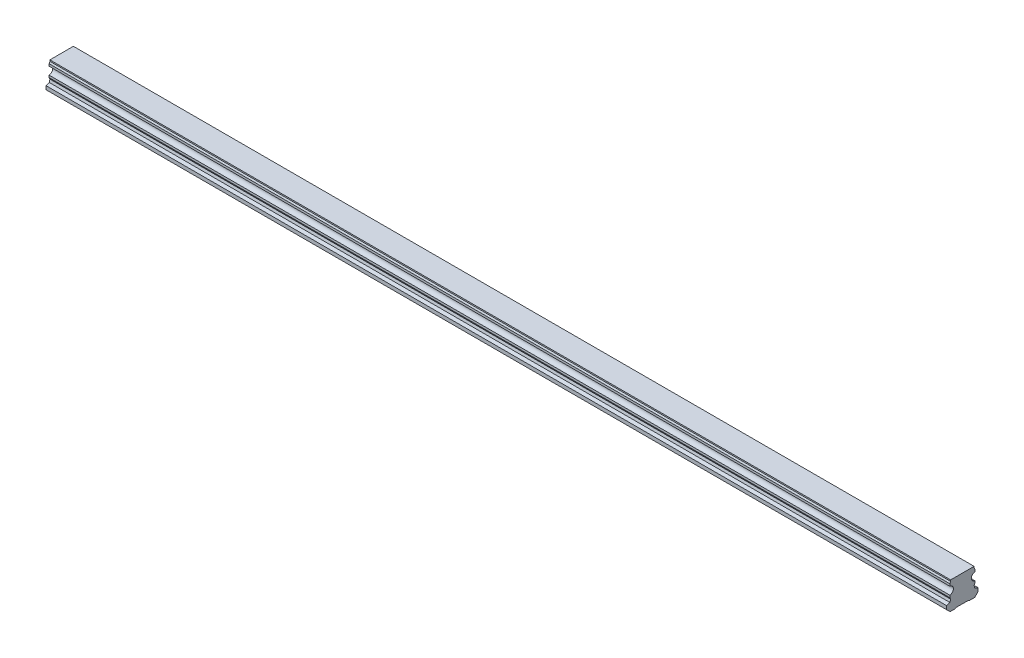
ISO-10303-21;
HEADER;
FILE_DESCRIPTION(('STEP AP214'),'2;1');
FILE_NAME('part.step','',(''),(''),'','','');
FILE_SCHEMA(('AUTOMOTIVE_DESIGN { 1 0 10303 214 1 1 1 1 }'));
ENDSEC;
DATA;
#1=APPLICATION_CONTEXT('core data for automotive mechanical design processes');
#2=APPLICATION_PROTOCOL_DEFINITION('international standard','automotive_design',2000,#1);
#3=PRODUCT_CONTEXT('',#1,'mechanical');
#4=PRODUCT('Part','Part','',(#3));
#5=PRODUCT_RELATED_PRODUCT_CATEGORY('part','',(#4));
#6=PRODUCT_DEFINITION_FORMATION('','',#4);
#7=PRODUCT_DEFINITION_CONTEXT('part definition',#1,'design');
#8=PRODUCT_DEFINITION('design','',#6,#7);
#9=PRODUCT_DEFINITION_SHAPE('','',#8);
#10=(LENGTH_UNIT() NAMED_UNIT(*) SI_UNIT(.MILLI.,.METRE.));
#11=(NAMED_UNIT(*) PLANE_ANGLE_UNIT() SI_UNIT($,.RADIAN.));
#12=(NAMED_UNIT(*) SI_UNIT($,.STERADIAN.) SOLID_ANGLE_UNIT());
#13=UNCERTAINTY_MEASURE_WITH_UNIT(LENGTH_MEASURE(1.E-05),#10,'distance_accuracy_value','');
#14=(GEOMETRIC_REPRESENTATION_CONTEXT(3) GLOBAL_UNCERTAINTY_ASSIGNED_CONTEXT((#13)) GLOBAL_UNIT_ASSIGNED_CONTEXT((#10,
#11,#12)) REPRESENTATION_CONTEXT('',''));
#15=CARTESIAN_POINT('',(0.,0.,0.));
#16=DIRECTION('',(0.,0.,1.));
#17=DIRECTION('',(1.,0.,0.));
#18=AXIS2_PLACEMENT_3D('',#15,#16,#17);
#19=CARTESIAN_POINT('',(690.,0.499999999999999,0.));
#20=DIRECTION('',(0.,-1.,0.));
#21=DIRECTION('',(0.,0.,-1.));
#22=AXIS2_PLACEMENT_3D('',#19,#20,#21);
#23=CONICAL_SURFACE('',#22,3.5,0.785398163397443);
#24=CARTESIAN_POINT('',(690.,1.00000000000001,0.));
#25=DIRECTION('',(0.,1.,0.));
#26=DIRECTION('',(0.,0.,1.));
#27=AXIS2_PLACEMENT_3D('',#24,#25,#26);
#28=CIRCLE('',#27,3.);
#29=CARTESIAN_POINT('',(690.,1.00000000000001,3.));
#30=VERTEX_POINT('',#29);
#31=EDGE_CURVE('E11',#30,#30,#28,.F.);
#32=ORIENTED_EDGE('',*,*,#31,.F.);
#33=EDGE_LOOP('',(#32));
#34=FACE_BOUND('',#33,.T.);
#35=CARTESIAN_POINT('',(690.,0.499999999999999,0.));
#36=DIRECTION('',(0.,1.,0.));
#37=DIRECTION('',(0.,0.,1.));
#38=AXIS2_PLACEMENT_3D('',#35,#36,#37);
#39=CIRCLE('',#38,3.5);
#40=CARTESIAN_POINT('',(690.,0.5,3.5));
#41=VERTEX_POINT('',#40);
#42=EDGE_CURVE('E542',#41,#41,#39,.T.);
#43=ORIENTED_EDGE('',*,*,#42,.F.);
#44=EDGE_LOOP('',(#43));
#45=FACE_BOUND('',#44,.T.);
#46=ADVANCED_FACE('F39',(#34,#45),#23,.F.);
#47=CARTESIAN_POINT('',(690.,12.,0.));
#48=DIRECTION('',(0.,-1.,0.));
#49=DIRECTION('',(0.,0.,-1.));
#50=AXIS2_PLACEMENT_3D('',#47,#48,#49);
#51=CYLINDRICAL_SURFACE('',#50,3.);
#52=ORIENTED_EDGE('',*,*,#31,.T.);
#53=EDGE_LOOP('',(#52));
#54=FACE_BOUND('',#53,.T.);
#55=CARTESIAN_POINT('',(690.,12.,0.));
#56=DIRECTION('',(0.,-1.,0.));
#57=DIRECTION('',(0.,0.,-1.));
#58=AXIS2_PLACEMENT_3D('',#55,#56,#57);
#59=CIRCLE('',#58,3.);
#60=CARTESIAN_POINT('',(690.,12.,-3.));
#61=VERTEX_POINT('',#60);
#62=EDGE_CURVE('E49',#61,#61,#59,.T.);
#63=ORIENTED_EDGE('',*,*,#62,.F.);
#64=EDGE_LOOP('',(#63));
#65=FACE_BOUND('',#64,.T.);
#66=ADVANCED_FACE('F744',(#54,#65),#51,.F.);
#67=CARTESIAN_POINT('',(690.,12.,0.));
#68=DIRECTION('',(0.,-1.,0.));
#69=DIRECTION('',(0.,0.,-1.));
#70=AXIS2_PLACEMENT_3D('',#67,#68,#69);
#71=PLANE('',#70);
#72=CARTESIAN_POINT('',(690.,12.,0.));
#73=DIRECTION('',(0.,-1.,0.));
#74=DIRECTION('',(0.,0.,-1.));
#75=AXIS2_PLACEMENT_3D('',#72,#73,#74);
#76=CIRCLE('',#75,2.5);
#77=CARTESIAN_POINT('',(690.,12.,-2.5));
#78=VERTEX_POINT('',#77);
#79=EDGE_CURVE('E42',#78,#78,#76,.T.);
#80=ORIENTED_EDGE('',*,*,#79,.F.);
#81=EDGE_LOOP('',(#80));
#82=FACE_BOUND('',#81,.T.);
#83=ORIENTED_EDGE('',*,*,#62,.T.);
#84=EDGE_LOOP('',(#83));
#85=FACE_BOUND('',#84,.T.);
#86=ADVANCED_FACE('F749',(#82,#85),#71,.T.);
#87=CARTESIAN_POINT('',(630.,0.499999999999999,0.));
#88=DIRECTION('',(0.,-1.,0.));
#89=DIRECTION('',(0.,0.,-1.));
#90=AXIS2_PLACEMENT_3D('',#87,#88,#89);
#91=CONICAL_SURFACE('',#90,3.5,0.785398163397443);
#92=CARTESIAN_POINT('',(630.,1.00000000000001,0.));
#93=DIRECTION('',(0.,1.,0.));
#94=DIRECTION('',(0.,0.,1.));
#95=AXIS2_PLACEMENT_3D('',#92,#93,#94);
#96=CIRCLE('',#95,3.);
#97=CARTESIAN_POINT('',(630.,1.00000000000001,3.));
#98=VERTEX_POINT('',#97);
#99=EDGE_CURVE('E538',#98,#98,#96,.F.);
#100=ORIENTED_EDGE('',*,*,#99,.F.);
#101=EDGE_LOOP('',(#100));
#102=FACE_BOUND('',#101,.T.);
#103=CARTESIAN_POINT('',(630.,0.499999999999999,0.));
#104=DIRECTION('',(0.,1.,0.));
#105=DIRECTION('',(0.,0.,1.));
#106=AXIS2_PLACEMENT_3D('',#103,#104,#105);
#107=CIRCLE('',#106,3.5);
#108=CARTESIAN_POINT('',(630.,0.5,3.5));
#109=VERTEX_POINT('',#108);
#110=EDGE_CURVE('E530',#109,#109,#107,.T.);
#111=ORIENTED_EDGE('',*,*,#110,.F.);
#112=EDGE_LOOP('',(#111));
#113=FACE_BOUND('',#112,.T.);
#114=ADVANCED_FACE('F932',(#102,#113),#91,.F.);
#115=CARTESIAN_POINT('',(630.,12.,0.));
#116=DIRECTION('',(0.,-1.,0.));
#117=DIRECTION('',(0.,0.,-1.));
#118=AXIS2_PLACEMENT_3D('',#115,#116,#117);
#119=CYLINDRICAL_SURFACE('',#118,3.);
#120=ORIENTED_EDGE('',*,*,#99,.T.);
#121=EDGE_LOOP('',(#120));
#122=FACE_BOUND('',#121,.T.);
#123=CARTESIAN_POINT('',(630.,12.,0.));
#124=DIRECTION('',(0.,-1.,0.));
#125=DIRECTION('',(0.,0.,-1.));
#126=AXIS2_PLACEMENT_3D('',#123,#124,#125);
#127=CIRCLE('',#126,3.);
#128=CARTESIAN_POINT('',(630.,12.,-3.));
#129=VERTEX_POINT('',#128);
#130=EDGE_CURVE('E534',#129,#129,#127,.T.);
#131=ORIENTED_EDGE('',*,*,#130,.F.);
#132=EDGE_LOOP('',(#131));
#133=FACE_BOUND('',#132,.T.);
#134=ADVANCED_FACE('F928',(#122,#133),#119,.F.);
#135=CARTESIAN_POINT('',(630.,12.,0.));
#136=DIRECTION('',(0.,-1.,0.));
#137=DIRECTION('',(0.,0.,-1.));
#138=AXIS2_PLACEMENT_3D('',#135,#136,#137);
#139=PLANE('',#138);
#140=CARTESIAN_POINT('',(630.,12.,0.));
#141=DIRECTION('',(0.,-1.,0.));
#142=DIRECTION('',(0.,0.,-1.));
#143=AXIS2_PLACEMENT_3D('',#140,#141,#142);
#144=CIRCLE('',#143,2.5);
#145=CARTESIAN_POINT('',(630.,12.,-2.5));
#146=VERTEX_POINT('',#145);
#147=EDGE_CURVE('E585',#146,#146,#144,.T.);
#148=ORIENTED_EDGE('',*,*,#147,.F.);
#149=EDGE_LOOP('',(#148));
#150=FACE_BOUND('',#149,.T.);
#151=ORIENTED_EDGE('',*,*,#130,.T.);
#152=EDGE_LOOP('',(#151));
#153=FACE_BOUND('',#152,.T.);
#154=ADVANCED_FACE('F924',(#150,#153),#139,.T.);
#155=CARTESIAN_POINT('',(570.,0.499999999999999,0.));
#156=DIRECTION('',(0.,-1.,0.));
#157=DIRECTION('',(0.,0.,-1.));
#158=AXIS2_PLACEMENT_3D('',#155,#156,#157);
#159=CONICAL_SURFACE('',#158,3.5,0.785398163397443);
#160=CARTESIAN_POINT('',(570.,1.00000000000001,0.));
#161=DIRECTION('',(0.,1.,0.));
#162=DIRECTION('',(0.,0.,1.));
#163=AXIS2_PLACEMENT_3D('',#160,#161,#162);
#164=CIRCLE('',#163,3.);
#165=CARTESIAN_POINT('',(570.,1.00000000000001,3.));
#166=VERTEX_POINT('',#165);
#167=EDGE_CURVE('E526',#166,#166,#164,.F.);
#168=ORIENTED_EDGE('',*,*,#167,.F.);
#169=EDGE_LOOP('',(#168));
#170=FACE_BOUND('',#169,.T.);
#171=CARTESIAN_POINT('',(570.,0.499999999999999,0.));
#172=DIRECTION('',(0.,1.,0.));
#173=DIRECTION('',(0.,0.,1.));
#174=AXIS2_PLACEMENT_3D('',#171,#172,#173);
#175=CIRCLE('',#174,3.5);
#176=CARTESIAN_POINT('',(570.,0.5,3.5));
#177=VERTEX_POINT('',#176);
#178=EDGE_CURVE('E518',#177,#177,#175,.T.);
#179=ORIENTED_EDGE('',*,*,#178,.F.);
#180=EDGE_LOOP('',(#179));
#181=FACE_BOUND('',#180,.T.);
#182=ADVANCED_FACE('F920',(#170,#181),#159,.F.);
#183=CARTESIAN_POINT('',(570.,12.,0.));
#184=DIRECTION('',(0.,-1.,0.));
#185=DIRECTION('',(0.,0.,-1.));
#186=AXIS2_PLACEMENT_3D('',#183,#184,#185);
#187=CYLINDRICAL_SURFACE('',#186,3.);
#188=ORIENTED_EDGE('',*,*,#167,.T.);
#189=EDGE_LOOP('',(#188));
#190=FACE_BOUND('',#189,.T.);
#191=CARTESIAN_POINT('',(570.,12.,0.));
#192=DIRECTION('',(0.,-1.,0.));
#193=DIRECTION('',(0.,0.,-1.));
#194=AXIS2_PLACEMENT_3D('',#191,#192,#193);
#195=CIRCLE('',#194,3.);
#196=CARTESIAN_POINT('',(570.,12.,-3.));
#197=VERTEX_POINT('',#196);
#198=EDGE_CURVE('E522',#197,#197,#195,.T.);
#199=ORIENTED_EDGE('',*,*,#198,.F.);
#200=EDGE_LOOP('',(#199));
#201=FACE_BOUND('',#200,.T.);
#202=ADVANCED_FACE('F916',(#190,#201),#187,.F.);
#203=CARTESIAN_POINT('',(570.,12.,0.));
#204=DIRECTION('',(0.,-1.,0.));
#205=DIRECTION('',(0.,0.,-1.));
#206=AXIS2_PLACEMENT_3D('',#203,#204,#205);
#207=PLANE('',#206);
#208=CARTESIAN_POINT('',(570.,12.,0.));
#209=DIRECTION('',(0.,-1.,0.));
#210=DIRECTION('',(0.,0.,-1.));
#211=AXIS2_PLACEMENT_3D('',#208,#209,#210);
#212=CIRCLE('',#211,2.5);
#213=CARTESIAN_POINT('',(570.,12.,-2.5));
#214=VERTEX_POINT('',#213);
#215=EDGE_CURVE('E582',#214,#214,#212,.T.);
#216=ORIENTED_EDGE('',*,*,#215,.F.);
#217=EDGE_LOOP('',(#216));
#218=FACE_BOUND('',#217,.T.);
#219=ORIENTED_EDGE('',*,*,#198,.T.);
#220=EDGE_LOOP('',(#219));
#221=FACE_BOUND('',#220,.T.);
#222=ADVANCED_FACE('F912',(#218,#221),#207,.T.);
#223=CARTESIAN_POINT('',(510.,0.499999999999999,0.));
#224=DIRECTION('',(0.,-1.,0.));
#225=DIRECTION('',(0.,0.,-1.));
#226=AXIS2_PLACEMENT_3D('',#223,#224,#225);
#227=CONICAL_SURFACE('',#226,3.5,0.785398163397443);
#228=CARTESIAN_POINT('',(510.,1.00000000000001,0.));
#229=DIRECTION('',(0.,1.,0.));
#230=DIRECTION('',(0.,0.,1.));
#231=AXIS2_PLACEMENT_3D('',#228,#229,#230);
#232=CIRCLE('',#231,3.);
#233=CARTESIAN_POINT('',(510.,1.00000000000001,3.));
#234=VERTEX_POINT('',#233);
#235=EDGE_CURVE('E514',#234,#234,#232,.F.);
#236=ORIENTED_EDGE('',*,*,#235,.F.);
#237=EDGE_LOOP('',(#236));
#238=FACE_BOUND('',#237,.T.);
#239=CARTESIAN_POINT('',(510.,0.499999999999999,0.));
#240=DIRECTION('',(0.,1.,0.));
#241=DIRECTION('',(0.,0.,1.));
#242=AXIS2_PLACEMENT_3D('',#239,#240,#241);
#243=CIRCLE('',#242,3.5);
#244=CARTESIAN_POINT('',(510.,0.5,3.5));
#245=VERTEX_POINT('',#244);
#246=EDGE_CURVE('E506',#245,#245,#243,.T.);
#247=ORIENTED_EDGE('',*,*,#246,.F.);
#248=EDGE_LOOP('',(#247));
#249=FACE_BOUND('',#248,.T.);
#250=ADVANCED_FACE('F908',(#238,#249),#227,.F.);
#251=CARTESIAN_POINT('',(510.,12.,0.));
#252=DIRECTION('',(0.,-1.,0.));
#253=DIRECTION('',(0.,0.,-1.));
#254=AXIS2_PLACEMENT_3D('',#251,#252,#253);
#255=CYLINDRICAL_SURFACE('',#254,3.);
#256=ORIENTED_EDGE('',*,*,#235,.T.);
#257=EDGE_LOOP('',(#256));
#258=FACE_BOUND('',#257,.T.);
#259=CARTESIAN_POINT('',(510.,12.,0.));
#260=DIRECTION('',(0.,-1.,0.));
#261=DIRECTION('',(0.,0.,-1.));
#262=AXIS2_PLACEMENT_3D('',#259,#260,#261);
#263=CIRCLE('',#262,3.);
#264=CARTESIAN_POINT('',(510.,12.,-3.));
#265=VERTEX_POINT('',#264);
#266=EDGE_CURVE('E510',#265,#265,#263,.T.);
#267=ORIENTED_EDGE('',*,*,#266,.F.);
#268=EDGE_LOOP('',(#267));
#269=FACE_BOUND('',#268,.T.);
#270=ADVANCED_FACE('F904',(#258,#269),#255,.F.);
#271=CARTESIAN_POINT('',(510.,12.,0.));
#272=DIRECTION('',(0.,-1.,0.));
#273=DIRECTION('',(0.,0.,-1.));
#274=AXIS2_PLACEMENT_3D('',#271,#272,#273);
#275=PLANE('',#274);
#276=CARTESIAN_POINT('',(510.,12.,0.));
#277=DIRECTION('',(0.,-1.,0.));
#278=DIRECTION('',(0.,0.,-1.));
#279=AXIS2_PLACEMENT_3D('',#276,#277,#278);
#280=CIRCLE('',#279,2.5);
#281=CARTESIAN_POINT('',(510.,12.,-2.5));
#282=VERTEX_POINT('',#281);
#283=EDGE_CURVE('E578',#282,#282,#280,.T.);
#284=ORIENTED_EDGE('',*,*,#283,.F.);
#285=EDGE_LOOP('',(#284));
#286=FACE_BOUND('',#285,.T.);
#287=ORIENTED_EDGE('',*,*,#266,.T.);
#288=EDGE_LOOP('',(#287));
#289=FACE_BOUND('',#288,.T.);
#290=ADVANCED_FACE('F900',(#286,#289),#275,.T.);
#291=CARTESIAN_POINT('',(450.,0.499999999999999,0.));
#292=DIRECTION('',(0.,-1.,0.));
#293=DIRECTION('',(0.,0.,-1.));
#294=AXIS2_PLACEMENT_3D('',#291,#292,#293);
#295=CONICAL_SURFACE('',#294,3.5,0.785398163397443);
#296=CARTESIAN_POINT('',(450.,1.00000000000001,0.));
#297=DIRECTION('',(0.,1.,0.));
#298=DIRECTION('',(0.,0.,1.));
#299=AXIS2_PLACEMENT_3D('',#296,#297,#298);
#300=CIRCLE('',#299,3.);
#301=CARTESIAN_POINT('',(450.,1.00000000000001,3.));
#302=VERTEX_POINT('',#301);
#303=EDGE_CURVE('E502',#302,#302,#300,.F.);
#304=ORIENTED_EDGE('',*,*,#303,.F.);
#305=EDGE_LOOP('',(#304));
#306=FACE_BOUND('',#305,.T.);
#307=CARTESIAN_POINT('',(450.,0.499999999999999,0.));
#308=DIRECTION('',(0.,1.,0.));
#309=DIRECTION('',(0.,0.,1.));
#310=AXIS2_PLACEMENT_3D('',#307,#308,#309);
#311=CIRCLE('',#310,3.5);
#312=CARTESIAN_POINT('',(450.,0.5,3.5));
#313=VERTEX_POINT('',#312);
#314=EDGE_CURVE('E494',#313,#313,#311,.T.);
#315=ORIENTED_EDGE('',*,*,#314,.F.);
#316=EDGE_LOOP('',(#315));
#317=FACE_BOUND('',#316,.T.);
#318=ADVANCED_FACE('F896',(#306,#317),#295,.F.);
#319=CARTESIAN_POINT('',(450.,12.,0.));
#320=DIRECTION('',(0.,-1.,0.));
#321=DIRECTION('',(0.,0.,-1.));
#322=AXIS2_PLACEMENT_3D('',#319,#320,#321);
#323=CYLINDRICAL_SURFACE('',#322,3.);
#324=ORIENTED_EDGE('',*,*,#303,.T.);
#325=EDGE_LOOP('',(#324));
#326=FACE_BOUND('',#325,.T.);
#327=CARTESIAN_POINT('',(450.,12.,0.));
#328=DIRECTION('',(0.,-1.,0.));
#329=DIRECTION('',(0.,0.,-1.));
#330=AXIS2_PLACEMENT_3D('',#327,#328,#329);
#331=CIRCLE('',#330,3.);
#332=CARTESIAN_POINT('',(450.,12.,-3.));
#333=VERTEX_POINT('',#332);
#334=EDGE_CURVE('E498',#333,#333,#331,.T.);
#335=ORIENTED_EDGE('',*,*,#334,.F.);
#336=EDGE_LOOP('',(#335));
#337=FACE_BOUND('',#336,.T.);
#338=ADVANCED_FACE('F892',(#326,#337),#323,.F.);
#339=CARTESIAN_POINT('',(450.,12.,0.));
#340=DIRECTION('',(0.,-1.,0.));
#341=DIRECTION('',(0.,0.,-1.));
#342=AXIS2_PLACEMENT_3D('',#339,#340,#341);
#343=PLANE('',#342);
#344=CARTESIAN_POINT('',(450.,12.,0.));
#345=DIRECTION('',(0.,-1.,0.));
#346=DIRECTION('',(0.,0.,-1.));
#347=AXIS2_PLACEMENT_3D('',#344,#345,#346);
#348=CIRCLE('',#347,2.5);
#349=CARTESIAN_POINT('',(450.,12.,-2.5));
#350=VERTEX_POINT('',#349);
#351=EDGE_CURVE('E574',#350,#350,#348,.T.);
#352=ORIENTED_EDGE('',*,*,#351,.F.);
#353=EDGE_LOOP('',(#352));
#354=FACE_BOUND('',#353,.T.);
#355=ORIENTED_EDGE('',*,*,#334,.T.);
#356=EDGE_LOOP('',(#355));
#357=FACE_BOUND('',#356,.T.);
#358=ADVANCED_FACE('F888',(#354,#357),#343,.T.);
#359=CARTESIAN_POINT('',(390.,0.499999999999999,0.));
#360=DIRECTION('',(0.,-1.,0.));
#361=DIRECTION('',(0.,0.,-1.));
#362=AXIS2_PLACEMENT_3D('',#359,#360,#361);
#363=CONICAL_SURFACE('',#362,3.5,0.785398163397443);
#364=CARTESIAN_POINT('',(390.,1.00000000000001,0.));
#365=DIRECTION('',(0.,1.,0.));
#366=DIRECTION('',(0.,0.,1.));
#367=AXIS2_PLACEMENT_3D('',#364,#365,#366);
#368=CIRCLE('',#367,3.);
#369=CARTESIAN_POINT('',(390.,1.00000000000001,3.));
#370=VERTEX_POINT('',#369);
#371=EDGE_CURVE('E490',#370,#370,#368,.F.);
#372=ORIENTED_EDGE('',*,*,#371,.F.);
#373=EDGE_LOOP('',(#372));
#374=FACE_BOUND('',#373,.T.);
#375=CARTESIAN_POINT('',(390.,0.499999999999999,0.));
#376=DIRECTION('',(0.,1.,0.));
#377=DIRECTION('',(0.,0.,1.));
#378=AXIS2_PLACEMENT_3D('',#375,#376,#377);
#379=CIRCLE('',#378,3.5);
#380=CARTESIAN_POINT('',(390.,0.5,3.5));
#381=VERTEX_POINT('',#380);
#382=EDGE_CURVE('E482',#381,#381,#379,.T.);
#383=ORIENTED_EDGE('',*,*,#382,.F.);
#384=EDGE_LOOP('',(#383));
#385=FACE_BOUND('',#384,.T.);
#386=ADVANCED_FACE('F884',(#374,#385),#363,.F.);
#387=CARTESIAN_POINT('',(390.,12.,0.));
#388=DIRECTION('',(0.,-1.,0.));
#389=DIRECTION('',(0.,0.,-1.));
#390=AXIS2_PLACEMENT_3D('',#387,#388,#389);
#391=CYLINDRICAL_SURFACE('',#390,3.);
#392=ORIENTED_EDGE('',*,*,#371,.T.);
#393=EDGE_LOOP('',(#392));
#394=FACE_BOUND('',#393,.T.);
#395=CARTESIAN_POINT('',(390.,12.,0.));
#396=DIRECTION('',(0.,-1.,0.));
#397=DIRECTION('',(0.,0.,-1.));
#398=AXIS2_PLACEMENT_3D('',#395,#396,#397);
#399=CIRCLE('',#398,3.);
#400=CARTESIAN_POINT('',(390.,12.,-3.));
#401=VERTEX_POINT('',#400);
#402=EDGE_CURVE('E486',#401,#401,#399,.T.);
#403=ORIENTED_EDGE('',*,*,#402,.F.);
#404=EDGE_LOOP('',(#403));
#405=FACE_BOUND('',#404,.T.);
#406=ADVANCED_FACE('F880',(#394,#405),#391,.F.);
#407=CARTESIAN_POINT('',(390.,12.,0.));
#408=DIRECTION('',(0.,-1.,0.));
#409=DIRECTION('',(0.,0.,-1.));
#410=AXIS2_PLACEMENT_3D('',#407,#408,#409);
#411=PLANE('',#410);
#412=CARTESIAN_POINT('',(390.,12.,0.));
#413=DIRECTION('',(0.,-1.,0.));
#414=DIRECTION('',(0.,0.,-1.));
#415=AXIS2_PLACEMENT_3D('',#412,#413,#414);
#416=CIRCLE('',#415,2.5);
#417=CARTESIAN_POINT('',(390.,12.,-2.5));
#418=VERTEX_POINT('',#417);
#419=EDGE_CURVE('E570',#418,#418,#416,.T.);
#420=ORIENTED_EDGE('',*,*,#419,.F.);
#421=EDGE_LOOP('',(#420));
#422=FACE_BOUND('',#421,.T.);
#423=ORIENTED_EDGE('',*,*,#402,.T.);
#424=EDGE_LOOP('',(#423));
#425=FACE_BOUND('',#424,.T.);
#426=ADVANCED_FACE('F876',(#422,#425),#411,.T.);
#427=CARTESIAN_POINT('',(330.,0.499999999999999,0.));
#428=DIRECTION('',(0.,-1.,0.));
#429=DIRECTION('',(0.,0.,-1.));
#430=AXIS2_PLACEMENT_3D('',#427,#428,#429);
#431=CONICAL_SURFACE('',#430,3.5,0.785398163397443);
#432=CARTESIAN_POINT('',(330.,1.00000000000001,0.));
#433=DIRECTION('',(0.,1.,0.));
#434=DIRECTION('',(0.,0.,1.));
#435=AXIS2_PLACEMENT_3D('',#432,#433,#434);
#436=CIRCLE('',#435,3.);
#437=CARTESIAN_POINT('',(330.,1.00000000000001,3.));
#438=VERTEX_POINT('',#437);
#439=EDGE_CURVE('E478',#438,#438,#436,.F.);
#440=ORIENTED_EDGE('',*,*,#439,.F.);
#441=EDGE_LOOP('',(#440));
#442=FACE_BOUND('',#441,.T.);
#443=CARTESIAN_POINT('',(330.,0.499999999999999,0.));
#444=DIRECTION('',(0.,1.,0.));
#445=DIRECTION('',(0.,0.,1.));
#446=AXIS2_PLACEMENT_3D('',#443,#444,#445);
#447=CIRCLE('',#446,3.5);
#448=CARTESIAN_POINT('',(330.,0.5,3.5));
#449=VERTEX_POINT('',#448);
#450=EDGE_CURVE('E470',#449,#449,#447,.T.);
#451=ORIENTED_EDGE('',*,*,#450,.F.);
#452=EDGE_LOOP('',(#451));
#453=FACE_BOUND('',#452,.T.);
#454=ADVANCED_FACE('F872',(#442,#453),#431,.F.);
#455=CARTESIAN_POINT('',(330.,12.,0.));
#456=DIRECTION('',(0.,-1.,0.));
#457=DIRECTION('',(0.,0.,-1.));
#458=AXIS2_PLACEMENT_3D('',#455,#456,#457);
#459=CYLINDRICAL_SURFACE('',#458,3.);
#460=ORIENTED_EDGE('',*,*,#439,.T.);
#461=EDGE_LOOP('',(#460));
#462=FACE_BOUND('',#461,.T.);
#463=CARTESIAN_POINT('',(330.,12.,0.));
#464=DIRECTION('',(0.,-1.,0.));
#465=DIRECTION('',(0.,0.,-1.));
#466=AXIS2_PLACEMENT_3D('',#463,#464,#465);
#467=CIRCLE('',#466,3.);
#468=CARTESIAN_POINT('',(330.,12.,-3.));
#469=VERTEX_POINT('',#468);
#470=EDGE_CURVE('E474',#469,#469,#467,.T.);
#471=ORIENTED_EDGE('',*,*,#470,.F.);
#472=EDGE_LOOP('',(#471));
#473=FACE_BOUND('',#472,.T.);
#474=ADVANCED_FACE('F868',(#462,#473),#459,.F.);
#475=CARTESIAN_POINT('',(330.,12.,0.));
#476=DIRECTION('',(0.,-1.,0.));
#477=DIRECTION('',(0.,0.,-1.));
#478=AXIS2_PLACEMENT_3D('',#475,#476,#477);
#479=PLANE('',#478);
#480=CARTESIAN_POINT('',(330.,12.,0.));
#481=DIRECTION('',(0.,-1.,0.));
#482=DIRECTION('',(0.,0.,-1.));
#483=AXIS2_PLACEMENT_3D('',#480,#481,#482);
#484=CIRCLE('',#483,2.5);
#485=CARTESIAN_POINT('',(330.,12.,-2.5));
#486=VERTEX_POINT('',#485);
#487=EDGE_CURVE('E566',#486,#486,#484,.T.);
#488=ORIENTED_EDGE('',*,*,#487,.F.);
#489=EDGE_LOOP('',(#488));
#490=FACE_BOUND('',#489,.T.);
#491=ORIENTED_EDGE('',*,*,#470,.T.);
#492=EDGE_LOOP('',(#491));
#493=FACE_BOUND('',#492,.T.);
#494=ADVANCED_FACE('F864',(#490,#493),#479,.T.);
#495=CARTESIAN_POINT('',(270.,0.499999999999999,0.));
#496=DIRECTION('',(0.,-1.,0.));
#497=DIRECTION('',(0.,0.,-1.));
#498=AXIS2_PLACEMENT_3D('',#495,#496,#497);
#499=CONICAL_SURFACE('',#498,3.5,0.785398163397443);
#500=CARTESIAN_POINT('',(270.,1.00000000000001,0.));
#501=DIRECTION('',(0.,1.,0.));
#502=DIRECTION('',(0.,0.,1.));
#503=AXIS2_PLACEMENT_3D('',#500,#501,#502);
#504=CIRCLE('',#503,3.);
#505=CARTESIAN_POINT('',(270.,1.00000000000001,3.));
#506=VERTEX_POINT('',#505);
#507=EDGE_CURVE('E466',#506,#506,#504,.F.);
#508=ORIENTED_EDGE('',*,*,#507,.F.);
#509=EDGE_LOOP('',(#508));
#510=FACE_BOUND('',#509,.T.);
#511=CARTESIAN_POINT('',(270.,0.499999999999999,0.));
#512=DIRECTION('',(0.,1.,0.));
#513=DIRECTION('',(0.,0.,1.));
#514=AXIS2_PLACEMENT_3D('',#511,#512,#513);
#515=CIRCLE('',#514,3.5);
#516=CARTESIAN_POINT('',(270.,0.5,3.5));
#517=VERTEX_POINT('',#516);
#518=EDGE_CURVE('E458',#517,#517,#515,.T.);
#519=ORIENTED_EDGE('',*,*,#518,.F.);
#520=EDGE_LOOP('',(#519));
#521=FACE_BOUND('',#520,.T.);
#522=ADVANCED_FACE('F860',(#510,#521),#499,.F.);
#523=CARTESIAN_POINT('',(270.,12.,0.));
#524=DIRECTION('',(0.,-1.,0.));
#525=DIRECTION('',(0.,0.,-1.));
#526=AXIS2_PLACEMENT_3D('',#523,#524,#525);
#527=CYLINDRICAL_SURFACE('',#526,3.);
#528=ORIENTED_EDGE('',*,*,#507,.T.);
#529=EDGE_LOOP('',(#528));
#530=FACE_BOUND('',#529,.T.);
#531=CARTESIAN_POINT('',(270.,12.,0.));
#532=DIRECTION('',(0.,-1.,0.));
#533=DIRECTION('',(0.,0.,-1.));
#534=AXIS2_PLACEMENT_3D('',#531,#532,#533);
#535=CIRCLE('',#534,3.);
#536=CARTESIAN_POINT('',(270.,12.,-3.));
#537=VERTEX_POINT('',#536);
#538=EDGE_CURVE('E462',#537,#537,#535,.T.);
#539=ORIENTED_EDGE('',*,*,#538,.F.);
#540=EDGE_LOOP('',(#539));
#541=FACE_BOUND('',#540,.T.);
#542=ADVANCED_FACE('F856',(#530,#541),#527,.F.);
#543=CARTESIAN_POINT('',(270.,12.,0.));
#544=DIRECTION('',(0.,-1.,0.));
#545=DIRECTION('',(0.,0.,-1.));
#546=AXIS2_PLACEMENT_3D('',#543,#544,#545);
#547=PLANE('',#546);
#548=CARTESIAN_POINT('',(270.,12.,0.));
#549=DIRECTION('',(0.,-1.,0.));
#550=DIRECTION('',(0.,0.,-1.));
#551=AXIS2_PLACEMENT_3D('',#548,#549,#550);
#552=CIRCLE('',#551,2.5);
#553=CARTESIAN_POINT('',(270.,12.,-2.5));
#554=VERTEX_POINT('',#553);
#555=EDGE_CURVE('E562',#554,#554,#552,.T.);
#556=ORIENTED_EDGE('',*,*,#555,.F.);
#557=EDGE_LOOP('',(#556));
#558=FACE_BOUND('',#557,.T.);
#559=ORIENTED_EDGE('',*,*,#538,.T.);
#560=EDGE_LOOP('',(#559));
#561=FACE_BOUND('',#560,.T.);
#562=ADVANCED_FACE('F852',(#558,#561),#547,.T.);
#563=CARTESIAN_POINT('',(210.,0.499999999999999,0.));
#564=DIRECTION('',(0.,-1.,0.));
#565=DIRECTION('',(0.,0.,-1.));
#566=AXIS2_PLACEMENT_3D('',#563,#564,#565);
#567=CONICAL_SURFACE('',#566,3.5,0.785398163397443);
#568=CARTESIAN_POINT('',(210.,1.00000000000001,0.));
#569=DIRECTION('',(0.,1.,0.));
#570=DIRECTION('',(0.,0.,1.));
#571=AXIS2_PLACEMENT_3D('',#568,#569,#570);
#572=CIRCLE('',#571,3.);
#573=CARTESIAN_POINT('',(210.,1.00000000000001,3.));
#574=VERTEX_POINT('',#573);
#575=EDGE_CURVE('E454',#574,#574,#572,.F.);
#576=ORIENTED_EDGE('',*,*,#575,.F.);
#577=EDGE_LOOP('',(#576));
#578=FACE_BOUND('',#577,.T.);
#579=CARTESIAN_POINT('',(210.,0.499999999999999,0.));
#580=DIRECTION('',(0.,1.,0.));
#581=DIRECTION('',(0.,0.,1.));
#582=AXIS2_PLACEMENT_3D('',#579,#580,#581);
#583=CIRCLE('',#582,3.5);
#584=CARTESIAN_POINT('',(210.,0.5,3.5));
#585=VERTEX_POINT('',#584);
#586=EDGE_CURVE('E446',#585,#585,#583,.T.);
#587=ORIENTED_EDGE('',*,*,#586,.F.);
#588=EDGE_LOOP('',(#587));
#589=FACE_BOUND('',#588,.T.);
#590=ADVANCED_FACE('F848',(#578,#589),#567,.F.);
#591=CARTESIAN_POINT('',(210.,12.,0.));
#592=DIRECTION('',(0.,-1.,0.));
#593=DIRECTION('',(0.,0.,-1.));
#594=AXIS2_PLACEMENT_3D('',#591,#592,#593);
#595=CYLINDRICAL_SURFACE('',#594,3.);
#596=ORIENTED_EDGE('',*,*,#575,.T.);
#597=EDGE_LOOP('',(#596));
#598=FACE_BOUND('',#597,.T.);
#599=CARTESIAN_POINT('',(210.,12.,0.));
#600=DIRECTION('',(0.,-1.,0.));
#601=DIRECTION('',(0.,0.,-1.));
#602=AXIS2_PLACEMENT_3D('',#599,#600,#601);
#603=CIRCLE('',#602,3.);
#604=CARTESIAN_POINT('',(210.,12.,-3.));
#605=VERTEX_POINT('',#604);
#606=EDGE_CURVE('E450',#605,#605,#603,.T.);
#607=ORIENTED_EDGE('',*,*,#606,.F.);
#608=EDGE_LOOP('',(#607));
#609=FACE_BOUND('',#608,.T.);
#610=ADVANCED_FACE('F844',(#598,#609),#595,.F.);
#611=CARTESIAN_POINT('',(210.,12.,0.));
#612=DIRECTION('',(0.,-1.,0.));
#613=DIRECTION('',(0.,0.,-1.));
#614=AXIS2_PLACEMENT_3D('',#611,#612,#613);
#615=PLANE('',#614);
#616=CARTESIAN_POINT('',(210.,12.,0.));
#617=DIRECTION('',(0.,-1.,0.));
#618=DIRECTION('',(0.,0.,-1.));
#619=AXIS2_PLACEMENT_3D('',#616,#617,#618);
#620=CIRCLE('',#619,2.5);
#621=CARTESIAN_POINT('',(210.,12.,-2.5));
#622=VERTEX_POINT('',#621);
#623=EDGE_CURVE('E558',#622,#622,#620,.T.);
#624=ORIENTED_EDGE('',*,*,#623,.F.);
#625=EDGE_LOOP('',(#624));
#626=FACE_BOUND('',#625,.T.);
#627=ORIENTED_EDGE('',*,*,#606,.T.);
#628=EDGE_LOOP('',(#627));
#629=FACE_BOUND('',#628,.T.);
#630=ADVANCED_FACE('F840',(#626,#629),#615,.T.);
#631=CARTESIAN_POINT('',(150.,0.499999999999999,0.));
#632=DIRECTION('',(0.,-1.,0.));
#633=DIRECTION('',(0.,0.,-1.));
#634=AXIS2_PLACEMENT_3D('',#631,#632,#633);
#635=CONICAL_SURFACE('',#634,3.5,0.785398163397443);
#636=CARTESIAN_POINT('',(150.,1.00000000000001,0.));
#637=DIRECTION('',(0.,1.,0.));
#638=DIRECTION('',(0.,0.,1.));
#639=AXIS2_PLACEMENT_3D('',#636,#637,#638);
#640=CIRCLE('',#639,3.);
#641=CARTESIAN_POINT('',(150.,1.00000000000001,3.));
#642=VERTEX_POINT('',#641);
#643=EDGE_CURVE('E442',#642,#642,#640,.F.);
#644=ORIENTED_EDGE('',*,*,#643,.F.);
#645=EDGE_LOOP('',(#644));
#646=FACE_BOUND('',#645,.T.);
#647=CARTESIAN_POINT('',(150.,0.499999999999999,0.));
#648=DIRECTION('',(0.,1.,0.));
#649=DIRECTION('',(0.,0.,1.));
#650=AXIS2_PLACEMENT_3D('',#647,#648,#649);
#651=CIRCLE('',#650,3.5);
#652=CARTESIAN_POINT('',(150.,0.5,3.5));
#653=VERTEX_POINT('',#652);
#654=EDGE_CURVE('E434',#653,#653,#651,.T.);
#655=ORIENTED_EDGE('',*,*,#654,.F.);
#656=EDGE_LOOP('',(#655));
#657=FACE_BOUND('',#656,.T.);
#658=ADVANCED_FACE('F836',(#646,#657),#635,.F.);
#659=CARTESIAN_POINT('',(150.,12.,0.));
#660=DIRECTION('',(0.,-1.,0.));
#661=DIRECTION('',(0.,0.,-1.));
#662=AXIS2_PLACEMENT_3D('',#659,#660,#661);
#663=CYLINDRICAL_SURFACE('',#662,3.);
#664=ORIENTED_EDGE('',*,*,#643,.T.);
#665=EDGE_LOOP('',(#664));
#666=FACE_BOUND('',#665,.T.);
#667=CARTESIAN_POINT('',(150.,12.,0.));
#668=DIRECTION('',(0.,-1.,0.));
#669=DIRECTION('',(0.,0.,-1.));
#670=AXIS2_PLACEMENT_3D('',#667,#668,#669);
#671=CIRCLE('',#670,3.);
#672=CARTESIAN_POINT('',(150.,12.,-3.));
#673=VERTEX_POINT('',#672);
#674=EDGE_CURVE('E438',#673,#673,#671,.T.);
#675=ORIENTED_EDGE('',*,*,#674,.F.);
#676=EDGE_LOOP('',(#675));
#677=FACE_BOUND('',#676,.T.);
#678=ADVANCED_FACE('F832',(#666,#677),#663,.F.);
#679=CARTESIAN_POINT('',(150.,12.,0.));
#680=DIRECTION('',(0.,-1.,0.));
#681=DIRECTION('',(0.,0.,-1.));
#682=AXIS2_PLACEMENT_3D('',#679,#680,#681);
#683=PLANE('',#682);
#684=CARTESIAN_POINT('',(150.,12.,0.));
#685=DIRECTION('',(0.,-1.,0.));
#686=DIRECTION('',(0.,0.,-1.));
#687=AXIS2_PLACEMENT_3D('',#684,#685,#686);
#688=CIRCLE('',#687,2.5);
#689=CARTESIAN_POINT('',(150.,12.,-2.5));
#690=VERTEX_POINT('',#689);
#691=EDGE_CURVE('E553',#690,#690,#688,.T.);
#692=ORIENTED_EDGE('',*,*,#691,.F.);
#693=EDGE_LOOP('',(#692));
#694=FACE_BOUND('',#693,.T.);
#695=ORIENTED_EDGE('',*,*,#674,.T.);
#696=EDGE_LOOP('',(#695));
#697=FACE_BOUND('',#696,.T.);
#698=ADVANCED_FACE('F822',(#694,#697),#683,.T.);
#699=CARTESIAN_POINT('',(720.,21.8,-9.375));
#700=DIRECTION('',(0.,0.,1.));
#701=DIRECTION('',(0.,-1.,0.));
#702=AXIS2_PLACEMENT_3D('',#699,#700,#701);
#703=PLANE('',#702);
#704=DIRECTION('',(0.,1.,0.));
#705=VECTOR('',#704,1.);
#706=CARTESIAN_POINT('',(0.,21.8,-9.375));
#707=LINE('',#706,#705);
#708=CARTESIAN_POINT('',(0.,20.756,-9.375));
#709=VERTEX_POINT('',#708);
#710=CARTESIAN_POINT('',(0.,21.8,-9.375));
#711=VERTEX_POINT('',#710);
#712=EDGE_CURVE('E255',#709,#711,#707,.T.);
#713=ORIENTED_EDGE('',*,*,#712,.T.);
#714=DIRECTION('',(-1.,0.,0.));
#715=VECTOR('',#714,1.);
#716=CARTESIAN_POINT('',(720.,21.8,-9.375));
#717=LINE('',#716,#715);
#718=CARTESIAN_POINT('',(720.,21.8,-9.375));
#719=VERTEX_POINT('',#718);
#720=EDGE_CURVE('E423',#719,#711,#717,.T.);
#721=ORIENTED_EDGE('',*,*,#720,.F.);
#722=DIRECTION('',(0.,1.,0.));
#723=VECTOR('',#722,1.);
#724=CARTESIAN_POINT('',(720.,21.8,-9.375));
#725=LINE('',#724,#723);
#726=CARTESIAN_POINT('',(720.,20.756,-9.375));
#727=VERTEX_POINT('',#726);
#728=EDGE_CURVE('E332',#727,#719,#725,.T.);
#729=ORIENTED_EDGE('',*,*,#728,.F.);
#730=DIRECTION('',(-1.,0.,0.));
#731=VECTOR('',#730,1.);
#732=CARTESIAN_POINT('',(720.,20.756,-9.375));
#733=LINE('',#732,#731);
#734=EDGE_CURVE('E251',#727,#709,#733,.T.);
#735=ORIENTED_EDGE('',*,*,#734,.T.);
#736=EDGE_LOOP('',(#713,#721,#729,#735));
#737=FACE_BOUND('',#736,.T.);
#738=ADVANCED_FACE('F819',(#737),#703,.F.);
#739=CARTESIAN_POINT('',(720.,21.8,-9.375));
#740=DIRECTION('',(0.,-1.,0.));
#741=DIRECTION('',(0.,0.,-1.));
#742=AXIS2_PLACEMENT_3D('',#739,#740,#741);
#743=PLANE('',#742);
#744=DIRECTION('',(0.,0.,1.));
#745=VECTOR('',#744,1.);
#746=CARTESIAN_POINT('',(0.,21.8,-9.375));
#747=LINE('',#746,#745);
#748=CARTESIAN_POINT('',(0.,21.8,9.375));
#749=VERTEX_POINT('',#748);
#750=EDGE_CURVE('E259',#711,#749,#747,.T.);
#751=ORIENTED_EDGE('',*,*,#750,.T.);
#752=DIRECTION('',(-1.,0.,0.));
#753=VECTOR('',#752,1.);
#754=CARTESIAN_POINT('',(720.,21.8,9.375));
#755=LINE('',#754,#753);
#756=CARTESIAN_POINT('',(720.,21.8,9.375));
#757=VERTEX_POINT('',#756);
#758=EDGE_CURVE('E419',#757,#749,#755,.T.);
#759=ORIENTED_EDGE('',*,*,#758,.F.);
#760=DIRECTION('',(0.,0.,1.));
#761=VECTOR('',#760,1.);
#762=CARTESIAN_POINT('',(720.,21.8,-9.375));
#763=LINE('',#762,#761);
#764=EDGE_CURVE('E157',#719,#757,#763,.T.);
#765=ORIENTED_EDGE('',*,*,#764,.F.);
#766=ORIENTED_EDGE('',*,*,#720,.T.);
#767=EDGE_LOOP('',(#751,#759,#765,#766));
#768=FACE_BOUND('',#767,.T.);
#769=ADVANCED_FACE('F815',(#768),#743,.F.);
#770=CARTESIAN_POINT('',(720.,21.8,9.375));
#771=DIRECTION('',(0.,0.,-1.));
#772=DIRECTION('',(0.,1.,0.));
#773=AXIS2_PLACEMENT_3D('',#770,#771,#772);
#774=PLANE('',#773);
#775=DIRECTION('',(0.,-1.,0.));
#776=VECTOR('',#775,1.);
#777=CARTESIAN_POINT('',(0.,21.8,9.375));
#778=LINE('',#777,#776);
#779=CARTESIAN_POINT('',(0.,20.756,9.37499999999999));
#780=VERTEX_POINT('',#779);
#781=EDGE_CURVE('E263',#749,#780,#778,.T.);
#782=ORIENTED_EDGE('',*,*,#781,.T.);
#783=DIRECTION('',(-1.,0.,0.));
#784=VECTOR('',#783,1.);
#785=CARTESIAN_POINT('',(720.,20.756,9.37499999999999));
#786=LINE('',#785,#784);
#787=CARTESIAN_POINT('',(720.,20.756,9.37499999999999));
#788=VERTEX_POINT('',#787);
#789=EDGE_CURVE('E415',#788,#780,#786,.T.);
#790=ORIENTED_EDGE('',*,*,#789,.F.);
#791=DIRECTION('',(0.,-1.,0.));
#792=VECTOR('',#791,1.);
#793=CARTESIAN_POINT('',(720.,21.8,9.375));
#794=LINE('',#793,#792);
#795=EDGE_CURVE('E627',#757,#788,#794,.T.);
#796=ORIENTED_EDGE('',*,*,#795,.F.);
#797=ORIENTED_EDGE('',*,*,#758,.T.);
#798=EDGE_LOOP('',(#782,#790,#796,#797));
#799=FACE_BOUND('',#798,.T.);
#800=ADVANCED_FACE('F811',(#799),#774,.F.);
#801=CARTESIAN_POINT('',(720.,20.756,9.37499999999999));
#802=DIRECTION('',(0.,-0.422618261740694,-0.906307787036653));
#803=DIRECTION('',(0.,0.906307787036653,-0.422618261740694));
#804=AXIS2_PLACEMENT_3D('',#801,#802,#803);
#805=PLANE('',#804);
#806=DIRECTION('',(0.,-0.906307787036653,0.422618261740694));
#807=VECTOR('',#806,1.);
#808=CARTESIAN_POINT('',(0.,20.756,9.37499999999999));
#809=LINE('',#808,#807);
#810=CARTESIAN_POINT('',(0.,19.4156831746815,10.));
#811=VERTEX_POINT('',#810);
#812=EDGE_CURVE('E266',#780,#811,#809,.T.);
#813=ORIENTED_EDGE('',*,*,#812,.T.);
#814=DIRECTION('',(-1.,0.,0.));
#815=VECTOR('',#814,1.);
#816=CARTESIAN_POINT('',(720.,19.4156831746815,10.));
#817=LINE('',#816,#815);
#818=CARTESIAN_POINT('',(720.,19.4156831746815,10.));
#819=VERTEX_POINT('',#818);
#820=EDGE_CURVE('E411',#819,#811,#817,.T.);
#821=ORIENTED_EDGE('',*,*,#820,.F.);
#822=DIRECTION('',(0.,-0.906307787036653,0.422618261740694));
#823=VECTOR('',#822,1.);
#824=CARTESIAN_POINT('',(720.,20.756,9.37499999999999));
#825=LINE('',#824,#823);
#826=EDGE_CURVE('E630',#788,#819,#825,.T.);
#827=ORIENTED_EDGE('',*,*,#826,.F.);
#828=ORIENTED_EDGE('',*,*,#789,.T.);
#829=EDGE_LOOP('',(#813,#821,#827,#828));
#830=FACE_BOUND('',#829,.T.);
#831=ADVANCED_FACE('F807',(#830),#805,.F.);
#832=CARTESIAN_POINT('',(720.,19.4156831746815,10.));
#833=DIRECTION('',(0.,0.,-1.));
#834=DIRECTION('',(-1.,0.,0.));
#835=AXIS2_PLACEMENT_3D('',#832,#833,#834);
#836=PLANE('',#835);
#837=DIRECTION('',(0.,-1.,0.));
#838=VECTOR('',#837,1.);
#839=CARTESIAN_POINT('',(0.,19.4156831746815,10.));
#840=LINE('',#839,#838);
#841=CARTESIAN_POINT('',(0.,17.6854497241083,10.));
#842=VERTEX_POINT('',#841);
#843=EDGE_CURVE('E269',#811,#842,#840,.T.);
#844=ORIENTED_EDGE('',*,*,#843,.T.);
#845=DIRECTION('',(-1.,0.,0.));
#846=VECTOR('',#845,1.);
#847=CARTESIAN_POINT('',(720.,17.6854497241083,10.));
#848=LINE('',#847,#846);
#849=CARTESIAN_POINT('',(720.,17.6854497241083,10.));
#850=VERTEX_POINT('',#849);
#851=EDGE_CURVE('E407',#850,#842,#848,.T.);
#852=ORIENTED_EDGE('',*,*,#851,.F.);
#853=DIRECTION('',(0.,-1.,0.));
#854=VECTOR('',#853,1.);
#855=CARTESIAN_POINT('',(720.,19.4156831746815,10.));
#856=LINE('',#855,#854);
#857=EDGE_CURVE('E633',#819,#850,#856,.T.);
#858=ORIENTED_EDGE('',*,*,#857,.F.);
#859=ORIENTED_EDGE('',*,*,#820,.T.);
#860=EDGE_LOOP('',(#844,#852,#858,#859));
#861=FACE_BOUND('',#860,.T.);
#862=ADVANCED_FACE('F803',(#861),#836,.F.);
#863=CARTESIAN_POINT('',(720.,14.6,10.3));
#864=DIRECTION('',(-1.,0.,0.));
#865=DIRECTION('',(0.,0.,1.));
#866=AXIS2_PLACEMENT_3D('',#863,#864,#865);
#867=CYLINDRICAL_SURFACE('',#866,3.1);
#868=CARTESIAN_POINT('',(0.,14.6,10.3));
#869=DIRECTION('',(-1.,0.,0.));
#870=DIRECTION('',(0.,0.,-1.));
#871=AXIS2_PLACEMENT_3D('',#868,#869,#870);
#872=CIRCLE('',#871,3.1);
#873=CARTESIAN_POINT('',(0.,11.5145502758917,10.));
#874=VERTEX_POINT('',#873);
#875=EDGE_CURVE('E272',#842,#874,#872,.T.);
#876=ORIENTED_EDGE('',*,*,#875,.T.);
#877=DIRECTION('',(-1.,0.,0.));
#878=VECTOR('',#877,1.);
#879=CARTESIAN_POINT('',(720.,11.5145502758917,10.));
#880=LINE('',#879,#878);
#881=CARTESIAN_POINT('',(720.,11.5145502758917,10.));
#882=VERTEX_POINT('',#881);
#883=EDGE_CURVE('E403',#882,#874,#880,.T.);
#884=ORIENTED_EDGE('',*,*,#883,.F.);
#885=CARTESIAN_POINT('',(720.,14.6,10.3));
#886=DIRECTION('',(-1.,0.,0.));
#887=DIRECTION('',(0.,0.,-1.));
#888=AXIS2_PLACEMENT_3D('',#885,#886,#887);
#889=CIRCLE('',#888,3.1);
#890=EDGE_CURVE('E636',#850,#882,#889,.T.);
#891=ORIENTED_EDGE('',*,*,#890,.F.);
#892=ORIENTED_EDGE('',*,*,#851,.T.);
#893=EDGE_LOOP('',(#876,#884,#891,#892));
#894=FACE_BOUND('',#893,.T.);
#895=ADVANCED_FACE('F799',(#894),#867,.F.);
#896=CARTESIAN_POINT('',(720.,9.78431682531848,10.));
#897=DIRECTION('',(0.,0.,-1.));
#898=DIRECTION('',(0.,1.,0.));
#899=AXIS2_PLACEMENT_3D('',#896,#897,#898);
#900=PLANE('',#899);
#901=DIRECTION('',(0.,-1.,0.));
#902=VECTOR('',#901,1.);
#903=CARTESIAN_POINT('',(0.,9.78431682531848,10.));
#904=LINE('',#903,#902);
#905=CARTESIAN_POINT('',(0.,9.78431682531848,10.));
#906=VERTEX_POINT('',#905);
#907=EDGE_CURVE('E275',#874,#906,#904,.T.);
#908=ORIENTED_EDGE('',*,*,#907,.T.);
#909=DIRECTION('',(-1.,0.,0.));
#910=VECTOR('',#909,1.);
#911=CARTESIAN_POINT('',(720.,9.78431682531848,10.));
#912=LINE('',#911,#910);
#913=CARTESIAN_POINT('',(720.,9.78431682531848,10.));
#914=VERTEX_POINT('',#913);
#915=EDGE_CURVE('E399',#914,#906,#912,.T.);
#916=ORIENTED_EDGE('',*,*,#915,.F.);
#917=DIRECTION('',(0.,-1.,0.));
#918=VECTOR('',#917,1.);
#919=CARTESIAN_POINT('',(720.,9.78431682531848,10.));
#920=LINE('',#919,#918);
#921=EDGE_CURVE('E639',#882,#914,#920,.T.);
#922=ORIENTED_EDGE('',*,*,#921,.F.);
#923=ORIENTED_EDGE('',*,*,#883,.T.);
#924=EDGE_LOOP('',(#908,#916,#922,#923));
#925=FACE_BOUND('',#924,.T.);
#926=ADVANCED_FACE('F795',(#925),#900,.F.);
#927=CARTESIAN_POINT('',(720.,8.44400000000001,9.375));
#928=DIRECTION('',(0.,0.4226182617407,-0.90630778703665));
#929=DIRECTION('',(0.,0.90630778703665,0.4226182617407));
#930=AXIS2_PLACEMENT_3D('',#927,#928,#929);
#931=PLANE('',#930);
#932=DIRECTION('',(0.,-0.90630778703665,-0.4226182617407));
#933=VECTOR('',#932,1.);
#934=CARTESIAN_POINT('',(0.,8.44400000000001,9.375));
#935=LINE('',#934,#933);
#936=CARTESIAN_POINT('',(0.,8.44400000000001,9.375));
#937=VERTEX_POINT('',#936);
#938=EDGE_CURVE('E278',#906,#937,#935,.T.);
#939=ORIENTED_EDGE('',*,*,#938,.T.);
#940=DIRECTION('',(-1.,0.,0.));
#941=VECTOR('',#940,1.);
#942=CARTESIAN_POINT('',(720.,8.44400000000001,9.375));
#943=LINE('',#942,#941);
#944=CARTESIAN_POINT('',(720.,8.44400000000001,9.375));
#945=VERTEX_POINT('',#944);
#946=EDGE_CURVE('E395',#945,#937,#943,.T.);
#947=ORIENTED_EDGE('',*,*,#946,.F.);
#948=DIRECTION('',(0.,-0.90630778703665,-0.4226182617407));
#949=VECTOR('',#948,1.);
#950=CARTESIAN_POINT('',(720.,8.44400000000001,9.375));
#951=LINE('',#950,#949);
#952=EDGE_CURVE('E642',#914,#945,#951,.T.);
#953=ORIENTED_EDGE('',*,*,#952,.F.);
#954=ORIENTED_EDGE('',*,*,#915,.T.);
#955=EDGE_LOOP('',(#939,#947,#953,#954));
#956=FACE_BOUND('',#955,.T.);
#957=ADVANCED_FACE('F791',(#956),#931,.F.);
#958=CARTESIAN_POINT('',(720.,6.4,9.92268814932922));
#959=DIRECTION('',(0.,-0.258819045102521,-0.965925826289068));
#960=DIRECTION('',(0.,0.965925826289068,-0.258819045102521));
#961=AXIS2_PLACEMENT_3D('',#958,#959,#960);
#962=PLANE('',#961);
#963=DIRECTION('',(0.,-0.965925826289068,0.258819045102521));
#964=VECTOR('',#963,1.);
#965=CARTESIAN_POINT('',(0.,6.4,9.92268814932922));
#966=LINE('',#965,#964);
#967=CARTESIAN_POINT('',(0.,6.4,9.92268814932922));
#968=VERTEX_POINT('',#967);
#969=EDGE_CURVE('E281',#937,#968,#966,.T.);
#970=ORIENTED_EDGE('',*,*,#969,.T.);
#971=DIRECTION('',(-1.,0.,0.));
#972=VECTOR('',#971,1.);
#973=CARTESIAN_POINT('',(720.,6.4,9.92268814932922));
#974=LINE('',#973,#972);
#975=CARTESIAN_POINT('',(720.,6.4,9.92268814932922));
#976=VERTEX_POINT('',#975);
#977=EDGE_CURVE('E391',#976,#968,#974,.T.);
#978=ORIENTED_EDGE('',*,*,#977,.F.);
#979=DIRECTION('',(0.,-0.965925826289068,0.258819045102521));
#980=VECTOR('',#979,1.);
#981=CARTESIAN_POINT('',(720.,6.4,9.92268814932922));
#982=LINE('',#981,#980);
#983=EDGE_CURVE('E645',#945,#976,#982,.T.);
#984=ORIENTED_EDGE('',*,*,#983,.F.);
#985=ORIENTED_EDGE('',*,*,#946,.T.);
#986=EDGE_LOOP('',(#970,#978,#984,#985));
#987=FACE_BOUND('',#986,.T.);
#988=ADVANCED_FACE('F787',(#987),#962,.F.);
#989=CARTESIAN_POINT('',(720.,5.48933857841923,12.5));
#990=DIRECTION('',(0.,-0.942872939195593,-0.333152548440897));
#991=DIRECTION('',(0.,0.333152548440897,-0.942872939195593));
#992=AXIS2_PLACEMENT_3D('',#989,#990,#991);
#993=PLANE('',#992);
#994=DIRECTION('',(0.,-0.333152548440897,0.942872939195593));
#995=VECTOR('',#994,1.);
#996=CARTESIAN_POINT('',(0.,5.48933857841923,12.5));
#997=LINE('',#996,#995);
#998=CARTESIAN_POINT('',(0.,5.48933857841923,12.5));
#999=VERTEX_POINT('',#998);
#1000=EDGE_CURVE('E284',#968,#999,#997,.T.);
#1001=ORIENTED_EDGE('',*,*,#1000,.T.);
#1002=DIRECTION('',(-1.,0.,0.));
#1003=VECTOR('',#1002,1.);
#1004=CARTESIAN_POINT('',(720.,5.48933857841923,12.5));
#1005=LINE('',#1004,#1003);
#1006=CARTESIAN_POINT('',(720.,5.48933857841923,12.5));
#1007=VERTEX_POINT('',#1006);
#1008=EDGE_CURVE('E387',#1007,#999,#1005,.T.);
#1009=ORIENTED_EDGE('',*,*,#1008,.F.);
#1010=DIRECTION('',(0.,-0.333152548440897,0.942872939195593));
#1011=VECTOR('',#1010,1.);
#1012=CARTESIAN_POINT('',(720.,5.48933857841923,12.5));
#1013=LINE('',#1012,#1011);
#1014=EDGE_CURVE('E648',#976,#1007,#1013,.T.);
#1015=ORIENTED_EDGE('',*,*,#1014,.F.);
#1016=ORIENTED_EDGE('',*,*,#977,.T.);
#1017=EDGE_LOOP('',(#1001,#1009,#1015,#1016));
#1018=FACE_BOUND('',#1017,.T.);
#1019=ADVANCED_FACE('F783',(#1018),#993,.F.);
#1020=CARTESIAN_POINT('',(720.,2.65,12.5));
#1021=DIRECTION('',(0.,0.,-1.));
#1022=DIRECTION('',(0.,1.,0.));
#1023=AXIS2_PLACEMENT_3D('',#1020,#1021,#1022);
#1024=PLANE('',#1023);
#1025=DIRECTION('',(0.,-1.,0.));
#1026=VECTOR('',#1025,1.);
#1027=CARTESIAN_POINT('',(0.,2.65,12.5));
#1028=LINE('',#1027,#1026);
#1029=CARTESIAN_POINT('',(0.,2.65,12.5));
#1030=VERTEX_POINT('',#1029);
#1031=EDGE_CURVE('E287',#999,#1030,#1028,.T.);
#1032=ORIENTED_EDGE('',*,*,#1031,.T.);
#1033=DIRECTION('',(-1.,0.,0.));
#1034=VECTOR('',#1033,1.);
#1035=CARTESIAN_POINT('',(720.,2.65,12.5));
#1036=LINE('',#1035,#1034);
#1037=CARTESIAN_POINT('',(720.,2.65,12.5));
#1038=VERTEX_POINT('',#1037);
#1039=EDGE_CURVE('E383',#1038,#1030,#1036,.T.);
#1040=ORIENTED_EDGE('',*,*,#1039,.F.);
#1041=DIRECTION('',(0.,-1.,0.));
#1042=VECTOR('',#1041,1.);
#1043=CARTESIAN_POINT('',(720.,2.65,12.5));
#1044=LINE('',#1043,#1042);
#1045=EDGE_CURVE('E651',#1007,#1038,#1044,.T.);
#1046=ORIENTED_EDGE('',*,*,#1045,.F.);
#1047=ORIENTED_EDGE('',*,*,#1008,.T.);
#1048=EDGE_LOOP('',(#1032,#1040,#1046,#1047));
#1049=FACE_BOUND('',#1048,.T.);
#1050=ADVANCED_FACE('F779',(#1049),#1024,.F.);
#1051=CARTESIAN_POINT('',(720.,0.,9.85));
#1052=DIRECTION('',(0.,0.707106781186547,-0.707106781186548));
#1053=DIRECTION('',(0.,0.707106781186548,0.707106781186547));
#1054=AXIS2_PLACEMENT_3D('',#1051,#1052,#1053);
#1055=PLANE('',#1054);
#1056=DIRECTION('',(0.,-0.707106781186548,-0.707106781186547));
#1057=VECTOR('',#1056,1.);
#1058=CARTESIAN_POINT('',(0.,0.,9.85));
#1059=LINE('',#1058,#1057);
#1060=CARTESIAN_POINT('',(0.,0.,9.85));
#1061=VERTEX_POINT('',#1060);
#1062=EDGE_CURVE('E290',#1030,#1061,#1059,.T.);
#1063=ORIENTED_EDGE('',*,*,#1062,.T.);
#1064=DIRECTION('',(-1.,0.,0.));
#1065=VECTOR('',#1064,1.);
#1066=CARTESIAN_POINT('',(720.,0.,9.85));
#1067=LINE('',#1066,#1065);
#1068=CARTESIAN_POINT('',(720.,0.,9.85));
#1069=VERTEX_POINT('',#1068);
#1070=EDGE_CURVE('E379',#1069,#1061,#1067,.T.);
#1071=ORIENTED_EDGE('',*,*,#1070,.F.);
#1072=DIRECTION('',(0.,-0.707106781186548,-0.707106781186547));
#1073=VECTOR('',#1072,1.);
#1074=CARTESIAN_POINT('',(720.,0.,9.85));
#1075=LINE('',#1074,#1073);
#1076=EDGE_CURVE('E653',#1038,#1069,#1075,.T.);
#1077=ORIENTED_EDGE('',*,*,#1076,.F.);
#1078=ORIENTED_EDGE('',*,*,#1039,.T.);
#1079=EDGE_LOOP('',(#1063,#1071,#1077,#1078));
#1080=FACE_BOUND('',#1079,.T.);
#1081=ADVANCED_FACE('F775',(#1080),#1055,.F.);
#1082=CARTESIAN_POINT('',(720.,0.,5.5));
#1083=DIRECTION('',(0.,1.,0.));
#1084=DIRECTION('',(0.,0.,1.));
#1085=AXIS2_PLACEMENT_3D('',#1082,#1083,#1084);
#1086=PLANE('',#1085);
#1087=DIRECTION('',(0.,0.,-1.));
#1088=VECTOR('',#1087,1.);
#1089=CARTESIAN_POINT('',(0.,0.,5.5));
#1090=LINE('',#1089,#1088);
#1091=CARTESIAN_POINT('',(0.,0.,5.5));
#1092=VERTEX_POINT('',#1091);
#1093=EDGE_CURVE('E293',#1061,#1092,#1090,.T.);
#1094=ORIENTED_EDGE('',*,*,#1093,.T.);
#1095=DIRECTION('',(-1.,0.,0.));
#1096=VECTOR('',#1095,1.);
#1097=CARTESIAN_POINT('',(720.,0.,5.5));
#1098=LINE('',#1097,#1096);
#1099=CARTESIAN_POINT('',(720.,0.,5.5));
#1100=VERTEX_POINT('',#1099);
#1101=EDGE_CURVE('E375',#1100,#1092,#1098,.T.);
#1102=ORIENTED_EDGE('',*,*,#1101,.F.);
#1103=DIRECTION('',(0.,0.,-1.));
#1104=VECTOR('',#1103,1.);
#1105=CARTESIAN_POINT('',(720.,0.,5.5));
#1106=LINE('',#1105,#1104);
#1107=EDGE_CURVE('E656',#1069,#1100,#1106,.T.);
#1108=ORIENTED_EDGE('',*,*,#1107,.F.);
#1109=ORIENTED_EDGE('',*,*,#1070,.T.);
#1110=EDGE_LOOP('',(#1094,#1102,#1108,#1109));
#1111=FACE_BOUND('',#1110,.T.);
#1112=ADVANCED_FACE('F767',(#1111),#1086,.F.);
#1113=CARTESIAN_POINT('',(720.,0.5,5.));
#1114=DIRECTION('',(0.,0.707106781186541,0.707106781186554));
#1115=DIRECTION('',(0.,-0.707106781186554,0.707106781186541));
#1116=AXIS2_PLACEMENT_3D('',#1113,#1114,#1115);
#1117=PLANE('',#1116);
#1118=DIRECTION('',(0.,0.707106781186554,-0.707106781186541));
#1119=VECTOR('',#1118,1.);
#1120=CARTESIAN_POINT('',(0.,0.5,5.));
#1121=LINE('',#1120,#1119);
#1122=CARTESIAN_POINT('',(0.,0.5,5.));
#1123=VERTEX_POINT('',#1122);
#1124=EDGE_CURVE('E296',#1092,#1123,#1121,.T.);
#1125=ORIENTED_EDGE('',*,*,#1124,.T.);
#1126=DIRECTION('',(-1.,0.,0.));
#1127=VECTOR('',#1126,1.);
#1128=CARTESIAN_POINT('',(720.,0.5,5.));
#1129=LINE('',#1128,#1127);
#1130=CARTESIAN_POINT('',(720.,0.5,5.));
#1131=VERTEX_POINT('',#1130);
#1132=EDGE_CURVE('E371',#1131,#1123,#1129,.T.);
#1133=ORIENTED_EDGE('',*,*,#1132,.F.);
#1134=DIRECTION('',(0.,0.707106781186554,-0.707106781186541));
#1135=VECTOR('',#1134,1.);
#1136=CARTESIAN_POINT('',(720.,0.5,5.));
#1137=LINE('',#1136,#1135);
#1138=EDGE_CURVE('E659',#1100,#1131,#1137,.T.);
#1139=ORIENTED_EDGE('',*,*,#1138,.F.);
#1140=ORIENTED_EDGE('',*,*,#1101,.T.);
#1141=EDGE_LOOP('',(#1125,#1133,#1139,#1140));
#1142=FACE_BOUND('',#1141,.T.);
#1143=ADVANCED_FACE('F758',(#1142),#1117,.F.);
#1144=CARTESIAN_POINT('',(720.,0.499999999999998,-5.));
#1145=DIRECTION('',(0.,1.,0.));
#1146=DIRECTION('',(0.,0.,1.));
#1147=AXIS2_PLACEMENT_3D('',#1144,#1145,#1146);
#1148=PLANE('',#1147);
#1149=CARTESIAN_POINT('',(90.,0.499999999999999,0.));
#1150=DIRECTION('',(0.,1.,0.));
#1151=DIRECTION('',(0.,0.,1.));
#1152=AXIS2_PLACEMENT_3D('',#1149,#1150,#1151);
#1153=CIRCLE('',#1152,3.5);
#1154=CARTESIAN_POINT('',(90.,0.5,3.5));
#1155=VERTEX_POINT('',#1154);
#1156=EDGE_CURVE('E593',#1155,#1155,#1153,.T.);
#1157=ORIENTED_EDGE('',*,*,#1156,.T.);
#1158=EDGE_LOOP('',(#1157));
#1159=FACE_BOUND('',#1158,.T.);
#1160=CARTESIAN_POINT('',(30.,0.499999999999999,0.));
#1161=DIRECTION('',(0.,1.,0.));
#1162=DIRECTION('',(0.,0.,1.));
#1163=AXIS2_PLACEMENT_3D('',#1160,#1161,#1162);
#1164=CIRCLE('',#1163,3.5);
#1165=CARTESIAN_POINT('',(30.,0.5,3.5));
#1166=VERTEX_POINT('',#1165);
#1167=EDGE_CURVE('E426',#1166,#1166,#1164,.T.);
#1168=ORIENTED_EDGE('',*,*,#1167,.T.);
#1169=EDGE_LOOP('',(#1168));
#1170=FACE_BOUND('',#1169,.T.);
#1171=DIRECTION('',(0.,0.,-1.));
#1172=VECTOR('',#1171,1.);
#1173=CARTESIAN_POINT('',(0.,0.499999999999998,-5.));
#1174=LINE('',#1173,#1172);
#1175=CARTESIAN_POINT('',(0.,0.499999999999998,-5.));
#1176=VERTEX_POINT('',#1175);
#1177=EDGE_CURVE('E299',#1123,#1176,#1174,.T.);
#1178=ORIENTED_EDGE('',*,*,#1177,.T.);
#1179=DIRECTION('',(-1.,0.,0.));
#1180=VECTOR('',#1179,1.);
#1181=CARTESIAN_POINT('',(720.,0.499999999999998,-5.));
#1182=LINE('',#1181,#1180);
#1183=CARTESIAN_POINT('',(720.,0.499999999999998,-5.));
#1184=VERTEX_POINT('',#1183);
#1185=EDGE_CURVE('E367',#1184,#1176,#1182,.T.);
#1186=ORIENTED_EDGE('',*,*,#1185,.F.);
#1187=DIRECTION('',(0.,0.,-1.));
#1188=VECTOR('',#1187,1.);
#1189=CARTESIAN_POINT('',(720.,0.499999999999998,-5.));
#1190=LINE('',#1189,#1188);
#1191=EDGE_CURVE('E662',#1131,#1184,#1190,.T.);
#1192=ORIENTED_EDGE('',*,*,#1191,.F.);
#1193=ORIENTED_EDGE('',*,*,#1132,.T.);
#1194=EDGE_LOOP('',(#1178,#1186,#1192,#1193));
#1195=FACE_BOUND('',#1194,.T.);
#1196=ORIENTED_EDGE('',*,*,#654,.T.);
#1197=EDGE_LOOP('',(#1196));
#1198=FACE_BOUND('',#1197,.T.);
#1199=ORIENTED_EDGE('',*,*,#586,.T.);
#1200=EDGE_LOOP('',(#1199));
#1201=FACE_BOUND('',#1200,.T.);
#1202=ORIENTED_EDGE('',*,*,#518,.T.);
#1203=EDGE_LOOP('',(#1202));
#1204=FACE_BOUND('',#1203,.T.);
#1205=ORIENTED_EDGE('',*,*,#450,.T.);
#1206=EDGE_LOOP('',(#1205));
#1207=FACE_BOUND('',#1206,.T.);
#1208=ORIENTED_EDGE('',*,*,#382,.T.);
#1209=EDGE_LOOP('',(#1208));
#1210=FACE_BOUND('',#1209,.T.);
#1211=ORIENTED_EDGE('',*,*,#314,.T.);
#1212=EDGE_LOOP('',(#1211));
#1213=FACE_BOUND('',#1212,.T.);
#1214=ORIENTED_EDGE('',*,*,#246,.T.);
#1215=EDGE_LOOP('',(#1214));
#1216=FACE_BOUND('',#1215,.T.);
#1217=ORIENTED_EDGE('',*,*,#178,.T.);
#1218=EDGE_LOOP('',(#1217));
#1219=FACE_BOUND('',#1218,.T.);
#1220=ORIENTED_EDGE('',*,*,#110,.T.);
#1221=EDGE_LOOP('',(#1220));
#1222=FACE_BOUND('',#1221,.T.);
#1223=ORIENTED_EDGE('',*,*,#42,.T.);
#1224=EDGE_LOOP('',(#1223));
#1225=FACE_BOUND('',#1224,.T.);
#1226=ADVANCED_FACE('F755',(#1159,#1170,#1195,#1198,#1201,#1204,#1207,#1210,#1213,#1216,#1219,
#1222,#1225),#1148,.F.);
#1227=CARTESIAN_POINT('',(720.,0.,-5.5));
#1228=DIRECTION('',(0.,0.707106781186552,-0.707106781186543));
#1229=DIRECTION('',(0.,0.707106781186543,0.707106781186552));
#1230=AXIS2_PLACEMENT_3D('',#1227,#1228,#1229);
#1231=PLANE('',#1230);
#1232=DIRECTION('',(0.,-0.707106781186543,-0.707106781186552));
#1233=VECTOR('',#1232,1.);
#1234=CARTESIAN_POINT('',(0.,0.,-5.5));
#1235=LINE('',#1234,#1233);
#1236=CARTESIAN_POINT('',(0.,0.,-5.5));
#1237=VERTEX_POINT('',#1236);
#1238=EDGE_CURVE('E302',#1176,#1237,#1235,.T.);
#1239=ORIENTED_EDGE('',*,*,#1238,.T.);
#1240=DIRECTION('',(-1.,0.,0.));
#1241=VECTOR('',#1240,1.);
#1242=CARTESIAN_POINT('',(720.,0.,-5.5));
#1243=LINE('',#1242,#1241);
#1244=CARTESIAN_POINT('',(720.,0.,-5.5));
#1245=VERTEX_POINT('',#1244);
#1246=EDGE_CURVE('E363',#1245,#1237,#1243,.T.);
#1247=ORIENTED_EDGE('',*,*,#1246,.F.);
#1248=DIRECTION('',(0.,-0.707106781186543,-0.707106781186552));
#1249=VECTOR('',#1248,1.);
#1250=CARTESIAN_POINT('',(720.,0.,-5.5));
#1251=LINE('',#1250,#1249);
#1252=EDGE_CURVE('E665',#1184,#1245,#1251,.T.);
#1253=ORIENTED_EDGE('',*,*,#1252,.F.);
#1254=ORIENTED_EDGE('',*,*,#1185,.T.);
#1255=EDGE_LOOP('',(#1239,#1247,#1253,#1254));
#1256=FACE_BOUND('',#1255,.T.);
#1257=ADVANCED_FACE('F757',(#1256),#1231,.F.);
#1258=CARTESIAN_POINT('',(720.,0.,-9.85));
#1259=DIRECTION('',(0.,1.,0.));
#1260=DIRECTION('',(0.,0.,1.));
#1261=AXIS2_PLACEMENT_3D('',#1258,#1259,#1260);
#1262=PLANE('',#1261);
#1263=DIRECTION('',(0.,0.,-1.));
#1264=VECTOR('',#1263,1.);
#1265=CARTESIAN_POINT('',(0.,0.,-9.85));
#1266=LINE('',#1265,#1264);
#1267=CARTESIAN_POINT('',(0.,0.,-9.85));
#1268=VERTEX_POINT('',#1267);
#1269=EDGE_CURVE('E305',#1237,#1268,#1266,.T.);
#1270=ORIENTED_EDGE('',*,*,#1269,.T.);
#1271=DIRECTION('',(-1.,0.,0.));
#1272=VECTOR('',#1271,1.);
#1273=CARTESIAN_POINT('',(720.,0.,-9.85));
#1274=LINE('',#1273,#1272);
#1275=CARTESIAN_POINT('',(720.,0.,-9.85));
#1276=VERTEX_POINT('',#1275);
#1277=EDGE_CURVE('E359',#1276,#1268,#1274,.T.);
#1278=ORIENTED_EDGE('',*,*,#1277,.F.);
#1279=DIRECTION('',(0.,0.,-1.));
#1280=VECTOR('',#1279,1.);
#1281=CARTESIAN_POINT('',(720.,0.,-9.85));
#1282=LINE('',#1281,#1280);
#1283=EDGE_CURVE('E668',#1245,#1276,#1282,.T.);
#1284=ORIENTED_EDGE('',*,*,#1283,.F.);
#1285=ORIENTED_EDGE('',*,*,#1246,.T.);
#1286=EDGE_LOOP('',(#1270,#1278,#1284,#1285));
#1287=FACE_BOUND('',#1286,.T.);
#1288=ADVANCED_FACE('F764',(#1287),#1262,.F.);
#1289=CARTESIAN_POINT('',(720.,2.65,-12.5));
#1290=DIRECTION('',(0.,0.707106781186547,0.707106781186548));
#1291=DIRECTION('',(0.,-0.707106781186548,0.707106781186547));
#1292=AXIS2_PLACEMENT_3D('',#1289,#1290,#1291);
#1293=PLANE('',#1292);
#1294=DIRECTION('',(0.,0.707106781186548,-0.707106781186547));
#1295=VECTOR('',#1294,1.);
#1296=CARTESIAN_POINT('',(0.,2.65,-12.5));
#1297=LINE('',#1296,#1295);
#1298=CARTESIAN_POINT('',(0.,2.65,-12.5));
#1299=VERTEX_POINT('',#1298);
#1300=EDGE_CURVE('E308',#1268,#1299,#1297,.T.);
#1301=ORIENTED_EDGE('',*,*,#1300,.T.);
#1302=DIRECTION('',(-1.,0.,0.));
#1303=VECTOR('',#1302,1.);
#1304=CARTESIAN_POINT('',(720.,2.65,-12.5));
#1305=LINE('',#1304,#1303);
#1306=CARTESIAN_POINT('',(720.,2.65,-12.5));
#1307=VERTEX_POINT('',#1306);
#1308=EDGE_CURVE('E355',#1307,#1299,#1305,.T.);
#1309=ORIENTED_EDGE('',*,*,#1308,.F.);
#1310=DIRECTION('',(0.,0.707106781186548,-0.707106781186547));
#1311=VECTOR('',#1310,1.);
#1312=CARTESIAN_POINT('',(720.,2.65,-12.5));
#1313=LINE('',#1312,#1311);
#1314=EDGE_CURVE('E671',#1276,#1307,#1313,.T.);
#1315=ORIENTED_EDGE('',*,*,#1314,.F.);
#1316=ORIENTED_EDGE('',*,*,#1277,.T.);
#1317=EDGE_LOOP('',(#1301,#1309,#1315,#1316));
#1318=FACE_BOUND('',#1317,.T.);
#1319=ADVANCED_FACE('F1085',(#1318),#1293,.F.);
#1320=CARTESIAN_POINT('',(720.,5.48933857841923,-12.5));
#1321=DIRECTION('',(0.,0.,1.));
#1322=DIRECTION('',(0.,-1.,0.));
#1323=AXIS2_PLACEMENT_3D('',#1320,#1321,#1322);
#1324=PLANE('',#1323);
#1325=DIRECTION('',(0.,1.,0.));
#1326=VECTOR('',#1325,1.);
#1327=CARTESIAN_POINT('',(0.,5.48933857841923,-12.5));
#1328=LINE('',#1327,#1326);
#1329=CARTESIAN_POINT('',(0.,5.48933857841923,-12.5));
#1330=VERTEX_POINT('',#1329);
#1331=EDGE_CURVE('E311',#1299,#1330,#1328,.T.);
#1332=ORIENTED_EDGE('',*,*,#1331,.T.);
#1333=DIRECTION('',(-1.,0.,0.));
#1334=VECTOR('',#1333,1.);
#1335=CARTESIAN_POINT('',(720.,5.48933857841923,-12.5));
#1336=LINE('',#1335,#1334);
#1337=CARTESIAN_POINT('',(720.,5.48933857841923,-12.5));
#1338=VERTEX_POINT('',#1337);
#1339=EDGE_CURVE('E351',#1338,#1330,#1336,.T.);
#1340=ORIENTED_EDGE('',*,*,#1339,.F.);
#1341=DIRECTION('',(0.,1.,0.));
#1342=VECTOR('',#1341,1.);
#1343=CARTESIAN_POINT('',(720.,5.48933857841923,-12.5));
#1344=LINE('',#1343,#1342);
#1345=EDGE_CURVE('E674',#1307,#1338,#1344,.T.);
#1346=ORIENTED_EDGE('',*,*,#1345,.F.);
#1347=ORIENTED_EDGE('',*,*,#1308,.T.);
#1348=EDGE_LOOP('',(#1332,#1340,#1346,#1347));
#1349=FACE_BOUND('',#1348,.T.);
#1350=ADVANCED_FACE('F1093',(#1349),#1324,.F.);
#1351=CARTESIAN_POINT('',(720.,6.39999999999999,-9.92268814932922));
#1352=DIRECTION('',(0.,-0.942872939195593,0.333152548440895));
#1353=DIRECTION('',(0.,-0.333152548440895,-0.942872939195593));
#1354=AXIS2_PLACEMENT_3D('',#1351,#1352,#1353);
#1355=PLANE('',#1354);
#1356=DIRECTION('',(0.,0.333152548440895,0.942872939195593));
#1357=VECTOR('',#1356,1.);
#1358=CARTESIAN_POINT('',(0.,6.39999999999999,-9.92268814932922));
#1359=LINE('',#1358,#1357);
#1360=CARTESIAN_POINT('',(0.,6.39999999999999,-9.92268814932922));
#1361=VERTEX_POINT('',#1360);
#1362=EDGE_CURVE('E314',#1330,#1361,#1359,.T.);
#1363=ORIENTED_EDGE('',*,*,#1362,.T.);
#1364=DIRECTION('',(-1.,0.,0.));
#1365=VECTOR('',#1364,1.);
#1366=CARTESIAN_POINT('',(720.,6.39999999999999,-9.92268814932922));
#1367=LINE('',#1366,#1365);
#1368=CARTESIAN_POINT('',(720.,6.39999999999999,-9.92268814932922));
#1369=VERTEX_POINT('',#1368);
#1370=EDGE_CURVE('E347',#1369,#1361,#1367,.T.);
#1371=ORIENTED_EDGE('',*,*,#1370,.F.);
#1372=DIRECTION('',(0.,0.333152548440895,0.942872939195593));
#1373=VECTOR('',#1372,1.);
#1374=CARTESIAN_POINT('',(720.,6.39999999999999,-9.92268814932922));
#1375=LINE('',#1374,#1373);
#1376=EDGE_CURVE('E677',#1338,#1369,#1375,.T.);
#1377=ORIENTED_EDGE('',*,*,#1376,.F.);
#1378=ORIENTED_EDGE('',*,*,#1339,.T.);
#1379=EDGE_LOOP('',(#1363,#1371,#1377,#1378));
#1380=FACE_BOUND('',#1379,.T.);
#1381=ADVANCED_FACE('F1102',(#1380),#1355,.F.);
#1382=CARTESIAN_POINT('',(720.,8.44400000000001,-9.375));
#1383=DIRECTION('',(0.,-0.258819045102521,0.965925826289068));
#1384=DIRECTION('',(0.,-0.965925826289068,-0.258819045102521));
#1385=AXIS2_PLACEMENT_3D('',#1382,#1383,#1384);
#1386=PLANE('',#1385);
#1387=DIRECTION('',(0.,0.965925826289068,0.258819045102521));
#1388=VECTOR('',#1387,1.);
#1389=CARTESIAN_POINT('',(0.,8.44400000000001,-9.375));
#1390=LINE('',#1389,#1388);
#1391=CARTESIAN_POINT('',(0.,8.44400000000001,-9.375));
#1392=VERTEX_POINT('',#1391);
#1393=EDGE_CURVE('E317',#1361,#1392,#1390,.T.);
#1394=ORIENTED_EDGE('',*,*,#1393,.T.);
#1395=DIRECTION('',(-1.,0.,0.));
#1396=VECTOR('',#1395,1.);
#1397=CARTESIAN_POINT('',(720.,8.44400000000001,-9.375));
#1398=LINE('',#1397,#1396);
#1399=CARTESIAN_POINT('',(720.,8.44400000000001,-9.375));
#1400=VERTEX_POINT('',#1399);
#1401=EDGE_CURVE('E343',#1400,#1392,#1398,.T.);
#1402=ORIENTED_EDGE('',*,*,#1401,.F.);
#1403=DIRECTION('',(0.,0.965925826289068,0.258819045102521));
#1404=VECTOR('',#1403,1.);
#1405=CARTESIAN_POINT('',(720.,8.44400000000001,-9.375));
#1406=LINE('',#1405,#1404);
#1407=EDGE_CURVE('E680',#1369,#1400,#1406,.T.);
#1408=ORIENTED_EDGE('',*,*,#1407,.F.);
#1409=ORIENTED_EDGE('',*,*,#1370,.T.);
#1410=EDGE_LOOP('',(#1394,#1402,#1408,#1409));
#1411=FACE_BOUND('',#1410,.T.);
#1412=ADVANCED_FACE('F1111',(#1411),#1386,.F.);
#1413=CARTESIAN_POINT('',(720.,9.78431682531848,-10.));
#1414=DIRECTION('',(0.,0.4226182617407,0.90630778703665));
#1415=DIRECTION('',(0.,-0.90630778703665,0.4226182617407));
#1416=AXIS2_PLACEMENT_3D('',#1413,#1414,#1415);
#1417=PLANE('',#1416);
#1418=DIRECTION('',(0.,0.90630778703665,-0.4226182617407));
#1419=VECTOR('',#1418,1.);
#1420=CARTESIAN_POINT('',(0.,9.78431682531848,-10.));
#1421=LINE('',#1420,#1419);
#1422=CARTESIAN_POINT('',(0.,9.78431682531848,-10.));
#1423=VERTEX_POINT('',#1422);
#1424=EDGE_CURVE('E320',#1392,#1423,#1421,.T.);
#1425=ORIENTED_EDGE('',*,*,#1424,.T.);
#1426=DIRECTION('',(-1.,0.,0.));
#1427=VECTOR('',#1426,1.);
#1428=CARTESIAN_POINT('',(720.,9.78431682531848,-10.));
#1429=LINE('',#1428,#1427);
#1430=CARTESIAN_POINT('',(720.,9.78431682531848,-10.));
#1431=VERTEX_POINT('',#1430);
#1432=EDGE_CURVE('E339',#1431,#1423,#1429,.T.);
#1433=ORIENTED_EDGE('',*,*,#1432,.F.);
#1434=DIRECTION('',(0.,0.90630778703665,-0.4226182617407));
#1435=VECTOR('',#1434,1.);
#1436=CARTESIAN_POINT('',(720.,9.78431682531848,-10.));
#1437=LINE('',#1436,#1435);
#1438=EDGE_CURVE('E683',#1400,#1431,#1437,.T.);
#1439=ORIENTED_EDGE('',*,*,#1438,.F.);
#1440=ORIENTED_EDGE('',*,*,#1401,.T.);
#1441=EDGE_LOOP('',(#1425,#1433,#1439,#1440));
#1442=FACE_BOUND('',#1441,.T.);
#1443=ADVANCED_FACE('F1120',(#1442),#1417,.F.);
#1444=CARTESIAN_POINT('',(720.,11.5145502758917,-10.));
#1445=DIRECTION('',(0.,0.,1.));
#1446=DIRECTION('',(1.,0.,0.));
#1447=AXIS2_PLACEMENT_3D('',#1444,#1445,#1446);
#1448=PLANE('',#1447);
#1449=DIRECTION('',(0.,1.,0.));
#1450=VECTOR('',#1449,1.);
#1451=CARTESIAN_POINT('',(0.,11.5145502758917,-10.));
#1452=LINE('',#1451,#1450);
#1453=CARTESIAN_POINT('',(0.,11.5145502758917,-10.));
#1454=VERTEX_POINT('',#1453);
#1455=EDGE_CURVE('E323',#1423,#1454,#1452,.T.);
#1456=ORIENTED_EDGE('',*,*,#1455,.T.);
#1457=DIRECTION('',(-1.,0.,0.));
#1458=VECTOR('',#1457,1.);
#1459=CARTESIAN_POINT('',(720.,11.5145502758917,-10.));
#1460=LINE('',#1459,#1458);
#1461=CARTESIAN_POINT('',(720.,11.5145502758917,-10.));
#1462=VERTEX_POINT('',#1461);
#1463=EDGE_CURVE('E243',#1462,#1454,#1460,.T.);
#1464=ORIENTED_EDGE('',*,*,#1463,.F.);
#1465=DIRECTION('',(0.,1.,0.));
#1466=VECTOR('',#1465,1.);
#1467=CARTESIAN_POINT('',(720.,11.5145502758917,-10.));
#1468=LINE('',#1467,#1466);
#1469=EDGE_CURVE('E232',#1431,#1462,#1468,.T.);
#1470=ORIENTED_EDGE('',*,*,#1469,.F.);
#1471=ORIENTED_EDGE('',*,*,#1432,.T.);
#1472=EDGE_LOOP('',(#1456,#1464,#1470,#1471));
#1473=FACE_BOUND('',#1472,.T.);
#1474=ADVANCED_FACE('F1129',(#1473),#1448,.F.);
#1475=CARTESIAN_POINT('',(720.,14.6,-10.3));
#1476=DIRECTION('',(-1.,0.,0.));
#1477=DIRECTION('',(0.,0.,1.));
#1478=AXIS2_PLACEMENT_3D('',#1475,#1476,#1477);
#1479=CYLINDRICAL_SURFACE('',#1478,3.1);
#1480=CARTESIAN_POINT('',(0.,14.6,-10.3));
#1481=DIRECTION('',(-1.,0.,0.));
#1482=DIRECTION('',(0.,0.,-1.));
#1483=AXIS2_PLACEMENT_3D('',#1480,#1481,#1482);
#1484=CIRCLE('',#1483,3.1);
#1485=CARTESIAN_POINT('',(0.,17.6854497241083,-10.));
#1486=VERTEX_POINT('',#1485);
#1487=EDGE_CURVE('E241',#1454,#1486,#1484,.T.);
#1488=ORIENTED_EDGE('',*,*,#1487,.T.);
#1489=DIRECTION('',(-1.,0.,0.));
#1490=VECTOR('',#1489,1.);
#1491=CARTESIAN_POINT('',(720.,17.6854497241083,-10.));
#1492=LINE('',#1491,#1490);
#1493=CARTESIAN_POINT('',(720.,17.6854497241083,-10.));
#1494=VERTEX_POINT('',#1493);
#1495=EDGE_CURVE('E238',#1494,#1486,#1492,.T.);
#1496=ORIENTED_EDGE('',*,*,#1495,.F.);
#1497=CARTESIAN_POINT('',(720.,14.6,-10.3));
#1498=DIRECTION('',(-1.,0.,0.));
#1499=DIRECTION('',(0.,0.,-1.));
#1500=AXIS2_PLACEMENT_3D('',#1497,#1498,#1499);
#1501=CIRCLE('',#1500,3.1);
#1502=EDGE_CURVE('E226',#1462,#1494,#1501,.T.);
#1503=ORIENTED_EDGE('',*,*,#1502,.F.);
#1504=ORIENTED_EDGE('',*,*,#1463,.T.);
#1505=EDGE_LOOP('',(#1488,#1496,#1503,#1504));
#1506=FACE_BOUND('',#1505,.T.);
#1507=ADVANCED_FACE('F239',(#1506),#1479,.F.);
#1508=CARTESIAN_POINT('',(720.,19.4156831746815,-10.));
#1509=DIRECTION('',(0.,0.,1.));
#1510=DIRECTION('',(1.,0.,0.));
#1511=AXIS2_PLACEMENT_3D('',#1508,#1509,#1510);
#1512=PLANE('',#1511);
#1513=DIRECTION('',(0.,1.,0.));
#1514=VECTOR('',#1513,1.);
#1515=CARTESIAN_POINT('',(0.,19.4156831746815,-10.));
#1516=LINE('',#1515,#1514);
#1517=CARTESIAN_POINT('',(0.,19.4156831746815,-10.));
#1518=VERTEX_POINT('',#1517);
#1519=EDGE_CURVE('E142',#1486,#1518,#1516,.T.);
#1520=ORIENTED_EDGE('',*,*,#1519,.T.);
#1521=DIRECTION('',(-1.,0.,0.));
#1522=VECTOR('',#1521,1.);
#1523=CARTESIAN_POINT('',(720.,19.4156831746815,-10.));
#1524=LINE('',#1523,#1522);
#1525=CARTESIAN_POINT('',(720.,19.4156831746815,-10.));
#1526=VERTEX_POINT('',#1525);
#1527=EDGE_CURVE('E244',#1526,#1518,#1524,.T.);
#1528=ORIENTED_EDGE('',*,*,#1527,.F.);
#1529=DIRECTION('',(0.,1.,0.));
#1530=VECTOR('',#1529,1.);
#1531=CARTESIAN_POINT('',(720.,19.4156831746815,-10.));
#1532=LINE('',#1531,#1530);
#1533=EDGE_CURVE('E230',#1494,#1526,#1532,.T.);
#1534=ORIENTED_EDGE('',*,*,#1533,.F.);
#1535=ORIENTED_EDGE('',*,*,#1495,.T.);
#1536=EDGE_LOOP('',(#1520,#1528,#1534,#1535));
#1537=FACE_BOUND('',#1536,.T.);
#1538=ADVANCED_FACE('F246',(#1537),#1512,.F.);
#1539=CARTESIAN_POINT('',(720.,20.756,-9.375));
#1540=DIRECTION('',(0.,-0.422618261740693,0.906307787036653));
#1541=DIRECTION('',(0.,-0.906307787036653,-0.422618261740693));
#1542=AXIS2_PLACEMENT_3D('',#1539,#1540,#1541);
#1543=PLANE('',#1542);
#1544=DIRECTION('',(0.,0.906307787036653,0.422618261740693));
#1545=VECTOR('',#1544,1.);
#1546=CARTESIAN_POINT('',(0.,20.756,-9.375));
#1547=LINE('',#1546,#1545);
#1548=EDGE_CURVE('E148',#1518,#709,#1547,.T.);
#1549=ORIENTED_EDGE('',*,*,#1548,.T.);
#1550=ORIENTED_EDGE('',*,*,#734,.F.);
#1551=DIRECTION('',(0.,0.906307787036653,0.422618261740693));
#1552=VECTOR('',#1551,1.);
#1553=CARTESIAN_POINT('',(720.,20.756,-9.375));
#1554=LINE('',#1553,#1552);
#1555=EDGE_CURVE('E58',#1526,#727,#1554,.T.);
#1556=ORIENTED_EDGE('',*,*,#1555,.F.);
#1557=ORIENTED_EDGE('',*,*,#1527,.T.);
#1558=EDGE_LOOP('',(#1549,#1550,#1556,#1557));
#1559=FACE_BOUND('',#1558,.T.);
#1560=ADVANCED_FACE('F1153',(#1559),#1543,.F.);
#1561=CARTESIAN_POINT('',(720.,14.6,-10.3));
#1562=DIRECTION('',(1.,0.,0.));
#1563=DIRECTION('',(0.,0.,-1.));
#1564=AXIS2_PLACEMENT_3D('',#1561,#1562,#1563);
#1565=PLANE('',#1564);
#1566=ORIENTED_EDGE('',*,*,#728,.T.);
#1567=ORIENTED_EDGE('',*,*,#764,.T.);
#1568=ORIENTED_EDGE('',*,*,#795,.T.);
#1569=ORIENTED_EDGE('',*,*,#826,.T.);
#1570=ORIENTED_EDGE('',*,*,#857,.T.);
#1571=ORIENTED_EDGE('',*,*,#890,.T.);
#1572=ORIENTED_EDGE('',*,*,#921,.T.);
#1573=ORIENTED_EDGE('',*,*,#952,.T.);
#1574=ORIENTED_EDGE('',*,*,#983,.T.);
#1575=ORIENTED_EDGE('',*,*,#1014,.T.);
#1576=ORIENTED_EDGE('',*,*,#1045,.T.);
#1577=ORIENTED_EDGE('',*,*,#1076,.T.);
#1578=ORIENTED_EDGE('',*,*,#1107,.T.);
#1579=ORIENTED_EDGE('',*,*,#1138,.T.);
#1580=ORIENTED_EDGE('',*,*,#1191,.T.);
#1581=ORIENTED_EDGE('',*,*,#1252,.T.);
#1582=ORIENTED_EDGE('',*,*,#1283,.T.);
#1583=ORIENTED_EDGE('',*,*,#1314,.T.);
#1584=ORIENTED_EDGE('',*,*,#1345,.T.);
#1585=ORIENTED_EDGE('',*,*,#1376,.T.);
#1586=ORIENTED_EDGE('',*,*,#1407,.T.);
#1587=ORIENTED_EDGE('',*,*,#1438,.T.);
#1588=ORIENTED_EDGE('',*,*,#1469,.T.);
#1589=ORIENTED_EDGE('',*,*,#1502,.T.);
#1590=ORIENTED_EDGE('',*,*,#1533,.T.);
#1591=ORIENTED_EDGE('',*,*,#1555,.T.);
#1592=EDGE_LOOP('',(#1566,#1567,#1568,#1569,#1570,#1571,#1572,#1573,#1574,#1575,#1576,#1577,
#1578,#1579,#1580,#1581,#1582,#1583,#1584,#1585,#1586,#1587,#1588,#1589,#1590,#1591));
#1593=FACE_BOUND('',#1592,.T.);
#1594=ADVANCED_FACE('F228',(#1593),#1565,.T.);
#1595=CARTESIAN_POINT('',(0.,14.6,-10.3));
#1596=DIRECTION('',(1.,0.,0.));
#1597=DIRECTION('',(0.,0.,-1.));
#1598=AXIS2_PLACEMENT_3D('',#1595,#1596,#1597);
#1599=PLANE('',#1598);
#1600=ORIENTED_EDGE('',*,*,#712,.F.);
#1601=ORIENTED_EDGE('',*,*,#1548,.F.);
#1602=ORIENTED_EDGE('',*,*,#1519,.F.);
#1603=ORIENTED_EDGE('',*,*,#1487,.F.);
#1604=ORIENTED_EDGE('',*,*,#1455,.F.);
#1605=ORIENTED_EDGE('',*,*,#1424,.F.);
#1606=ORIENTED_EDGE('',*,*,#1393,.F.);
#1607=ORIENTED_EDGE('',*,*,#1362,.F.);
#1608=ORIENTED_EDGE('',*,*,#1331,.F.);
#1609=ORIENTED_EDGE('',*,*,#1300,.F.);
#1610=ORIENTED_EDGE('',*,*,#1269,.F.);
#1611=ORIENTED_EDGE('',*,*,#1238,.F.);
#1612=ORIENTED_EDGE('',*,*,#1177,.F.);
#1613=ORIENTED_EDGE('',*,*,#1124,.F.);
#1614=ORIENTED_EDGE('',*,*,#1093,.F.);
#1615=ORIENTED_EDGE('',*,*,#1062,.F.);
#1616=ORIENTED_EDGE('',*,*,#1031,.F.);
#1617=ORIENTED_EDGE('',*,*,#1000,.F.);
#1618=ORIENTED_EDGE('',*,*,#969,.F.);
#1619=ORIENTED_EDGE('',*,*,#938,.F.);
#1620=ORIENTED_EDGE('',*,*,#907,.F.);
#1621=ORIENTED_EDGE('',*,*,#875,.F.);
#1622=ORIENTED_EDGE('',*,*,#843,.F.);
#1623=ORIENTED_EDGE('',*,*,#812,.F.);
#1624=ORIENTED_EDGE('',*,*,#781,.F.);
#1625=ORIENTED_EDGE('',*,*,#750,.F.);
#1626=EDGE_LOOP('',(#1600,#1601,#1602,#1603,#1604,#1605,#1606,#1607,#1608,#1609,#1610,#1611,
#1612,#1613,#1614,#1615,#1616,#1617,#1618,#1619,#1620,#1621,#1622,#1623,#1624,#1625));
#1627=FACE_BOUND('',#1626,.T.);
#1628=ADVANCED_FACE('F1168',(#1627),#1599,.F.);
#1629=CARTESIAN_POINT('',(30.,12.,0.));
#1630=DIRECTION('',(0.,-1.,0.));
#1631=DIRECTION('',(0.,0.,-1.));
#1632=AXIS2_PLACEMENT_3D('',#1629,#1630,#1631);
#1633=CYLINDRICAL_SURFACE('',#1632,3.);
#1634=CARTESIAN_POINT('',(30.,1.00000000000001,0.));
#1635=DIRECTION('',(0.,1.,0.));
#1636=DIRECTION('',(0.,0.,1.));
#1637=AXIS2_PLACEMENT_3D('',#1634,#1635,#1636);
#1638=CIRCLE('',#1637,3.);
#1639=CARTESIAN_POINT('',(30.,1.00000000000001,3.));
#1640=VERTEX_POINT('',#1639);
#1641=EDGE_CURVE('E430',#1640,#1640,#1638,.F.);
#1642=ORIENTED_EDGE('',*,*,#1641,.T.);
#1643=EDGE_LOOP('',(#1642));
#1644=FACE_BOUND('',#1643,.T.);
#1645=CARTESIAN_POINT('',(30.,12.,0.));
#1646=DIRECTION('',(0.,-1.,0.));
#1647=DIRECTION('',(0.,0.,-1.));
#1648=AXIS2_PLACEMENT_3D('',#1645,#1646,#1647);
#1649=CIRCLE('',#1648,3.);
#1650=CARTESIAN_POINT('',(30.,12.,-3.));
#1651=VERTEX_POINT('',#1650);
#1652=EDGE_CURVE('E260',#1651,#1651,#1649,.T.);
#1653=ORIENTED_EDGE('',*,*,#1652,.F.);
#1654=EDGE_LOOP('',(#1653));
#1655=FACE_BOUND('',#1654,.T.);
#1656=ADVANCED_FACE('F1176',(#1644,#1655),#1633,.F.);
#1657=CARTESIAN_POINT('',(30.,12.,0.));
#1658=DIRECTION('',(0.,-1.,0.));
#1659=DIRECTION('',(0.,0.,-1.));
#1660=AXIS2_PLACEMENT_3D('',#1657,#1658,#1659);
#1661=PLANE('',#1660);
#1662=CARTESIAN_POINT('',(30.,12.,0.));
#1663=DIRECTION('',(0.,-1.,0.));
#1664=DIRECTION('',(0.,0.,-1.));
#1665=AXIS2_PLACEMENT_3D('',#1662,#1663,#1664);
#1666=CIRCLE('',#1665,2.5);
#1667=CARTESIAN_POINT('',(30.,12.,-2.5));
#1668=VERTEX_POINT('',#1667);
#1669=EDGE_CURVE('E616',#1668,#1668,#1666,.T.);
#1670=ORIENTED_EDGE('',*,*,#1669,.F.);
#1671=EDGE_LOOP('',(#1670));
#1672=FACE_BOUND('',#1671,.T.);
#1673=ORIENTED_EDGE('',*,*,#1652,.T.);
#1674=EDGE_LOOP('',(#1673));
#1675=FACE_BOUND('',#1674,.T.);
#1676=ADVANCED_FACE('F1186',(#1672,#1675),#1661,.T.);
#1677=CARTESIAN_POINT('',(30.,15.,0.));
#1678=DIRECTION('',(0.,-1.,0.));
#1679=DIRECTION('',(0.,0.,-1.));
#1680=AXIS2_PLACEMENT_3D('',#1677,#1678,#1679);
#1681=CYLINDRICAL_SURFACE('',#1680,2.5);
#1682=ORIENTED_EDGE('',*,*,#1669,.T.);
#1683=EDGE_LOOP('',(#1682));
#1684=FACE_BOUND('',#1683,.T.);
#1685=CARTESIAN_POINT('',(30.,15.,0.));
#1686=DIRECTION('',(0.,-1.,0.));
#1687=DIRECTION('',(0.,0.,-1.));
#1688=AXIS2_PLACEMENT_3D('',#1685,#1686,#1687);
#1689=CIRCLE('',#1688,2.5);
#1690=CARTESIAN_POINT('',(30.,15.,-2.5));
#1691=VERTEX_POINT('',#1690);
#1692=EDGE_CURVE('E612',#1691,#1691,#1689,.T.);
#1693=ORIENTED_EDGE('',*,*,#1692,.F.);
#1694=EDGE_LOOP('',(#1693));
#1695=FACE_BOUND('',#1694,.T.);
#1696=ADVANCED_FACE('F1196',(#1684,#1695),#1681,.F.);
#1697=CARTESIAN_POINT('',(30.,15.,0.));
#1698=DIRECTION('',(0.,-1.,0.));
#1699=DIRECTION('',(0.,0.,-1.));
#1700=AXIS2_PLACEMENT_3D('',#1697,#1698,#1699);
#1701=CONICAL_SURFACE('',#1700,2.5,1.0471975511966);
#1702=CARTESIAN_POINT('',(30.,16.4433756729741,0.));
#1703=VERTEX_POINT('',#1702);
#1704=VERTEX_LOOP('',#1703);
#1705=FACE_BOUND('',#1704,.T.);
#1706=ORIENTED_EDGE('',*,*,#1692,.T.);
#1707=EDGE_LOOP('',(#1706));
#1708=FACE_BOUND('',#1707,.T.);
#1709=ADVANCED_FACE('F828',(#1705,#1708),#1701,.F.);
#1710=CARTESIAN_POINT('',(30.,0.499999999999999,0.));
#1711=DIRECTION('',(0.,-1.,0.));
#1712=DIRECTION('',(0.,0.,-1.));
#1713=AXIS2_PLACEMENT_3D('',#1710,#1711,#1712);
#1714=CONICAL_SURFACE('',#1713,3.5,0.785398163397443);
#1715=ORIENTED_EDGE('',*,*,#1641,.F.);
#1716=EDGE_LOOP('',(#1715));
#1717=FACE_BOUND('',#1716,.T.);
#1718=ORIENTED_EDGE('',*,*,#1167,.F.);
#1719=EDGE_LOOP('',(#1718));
#1720=FACE_BOUND('',#1719,.T.);
#1721=ADVANCED_FACE('F824',(#1717,#1720),#1714,.F.);
#1722=CARTESIAN_POINT('',(90.,12.,0.));
#1723=DIRECTION('',(0.,-1.,0.));
#1724=DIRECTION('',(0.,0.,-1.));
#1725=AXIS2_PLACEMENT_3D('',#1722,#1723,#1724);
#1726=PLANE('',#1725);
#1727=CARTESIAN_POINT('',(90.,12.,0.));
#1728=DIRECTION('',(0.,-1.,0.));
#1729=DIRECTION('',(0.,0.,-1.));
#1730=AXIS2_PLACEMENT_3D('',#1727,#1728,#1729);
#1731=CIRCLE('',#1730,2.5);
#1732=CARTESIAN_POINT('',(90.,12.,-2.5));
#1733=VERTEX_POINT('',#1732);
#1734=EDGE_CURVE('E549',#1733,#1733,#1731,.T.);
#1735=ORIENTED_EDGE('',*,*,#1734,.F.);
#1736=EDGE_LOOP('',(#1735));
#1737=FACE_BOUND('',#1736,.T.);
#1738=CARTESIAN_POINT('',(90.,12.,0.));
#1739=DIRECTION('',(0.,-1.,0.));
#1740=DIRECTION('',(0.,0.,-1.));
#1741=AXIS2_PLACEMENT_3D('',#1738,#1739,#1740);
#1742=CIRCLE('',#1741,3.);
#1743=CARTESIAN_POINT('',(90.,12.,-3.));
#1744=VERTEX_POINT('',#1743);
#1745=EDGE_CURVE('E604',#1744,#1744,#1742,.T.);
#1746=ORIENTED_EDGE('',*,*,#1745,.T.);
#1747=EDGE_LOOP('',(#1746));
#1748=FACE_BOUND('',#1747,.T.);
#1749=ADVANCED_FACE('F827',(#1737,#1748),#1726,.T.);
#1750=CARTESIAN_POINT('',(90.,12.,0.));
#1751=DIRECTION('',(0.,-1.,0.));
#1752=DIRECTION('',(0.,0.,-1.));
#1753=AXIS2_PLACEMENT_3D('',#1750,#1751,#1752);
#1754=CYLINDRICAL_SURFACE('',#1753,3.);
#1755=CARTESIAN_POINT('',(90.,1.00000000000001,0.));
#1756=DIRECTION('',(0.,1.,0.));
#1757=DIRECTION('',(0.,0.,1.));
#1758=AXIS2_PLACEMENT_3D('',#1755,#1756,#1757);
#1759=CIRCLE('',#1758,3.);
#1760=CARTESIAN_POINT('',(90.,1.00000000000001,3.));
#1761=VERTEX_POINT('',#1760);
#1762=EDGE_CURVE('E598',#1761,#1761,#1759,.F.);
#1763=ORIENTED_EDGE('',*,*,#1762,.T.);
#1764=EDGE_LOOP('',(#1763));
#1765=FACE_BOUND('',#1764,.T.);
#1766=ORIENTED_EDGE('',*,*,#1745,.F.);
#1767=EDGE_LOOP('',(#1766));
#1768=FACE_BOUND('',#1767,.T.);
#1769=ADVANCED_FACE('F1224',(#1765,#1768),#1754,.F.);
#1770=CARTESIAN_POINT('',(90.,0.499999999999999,0.));
#1771=DIRECTION('',(0.,-1.,0.));
#1772=DIRECTION('',(0.,0.,-1.));
#1773=AXIS2_PLACEMENT_3D('',#1770,#1771,#1772);
#1774=CONICAL_SURFACE('',#1773,3.5,0.785398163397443);
#1775=ORIENTED_EDGE('',*,*,#1762,.F.);
#1776=EDGE_LOOP('',(#1775));
#1777=FACE_BOUND('',#1776,.T.);
#1778=ORIENTED_EDGE('',*,*,#1156,.F.);
#1779=EDGE_LOOP('',(#1778));
#1780=FACE_BOUND('',#1779,.T.);
#1781=ADVANCED_FACE('F1233',(#1777,#1780),#1774,.F.);
#1782=CARTESIAN_POINT('',(90.,15.,0.));
#1783=DIRECTION('',(0.,-1.,0.));
#1784=DIRECTION('',(0.,0.,-1.));
#1785=AXIS2_PLACEMENT_3D('',#1782,#1783,#1784);
#1786=CYLINDRICAL_SURFACE('',#1785,2.5);
#1787=ORIENTED_EDGE('',*,*,#1734,.T.);
#1788=EDGE_LOOP('',(#1787));
#1789=FACE_BOUND('',#1788,.T.);
#1790=CARTESIAN_POINT('',(90.,15.,0.));
#1791=DIRECTION('',(0.,-1.,0.));
#1792=DIRECTION('',(0.,0.,-1.));
#1793=AXIS2_PLACEMENT_3D('',#1790,#1791,#1792);
#1794=CIRCLE('',#1793,2.5);
#1795=CARTESIAN_POINT('',(90.,15.,-2.5));
#1796=VERTEX_POINT('',#1795);
#1797=EDGE_CURVE('E554',#1796,#1796,#1794,.T.);
#1798=ORIENTED_EDGE('',*,*,#1797,.F.);
#1799=EDGE_LOOP('',(#1798));
#1800=FACE_BOUND('',#1799,.T.);
#1801=ADVANCED_FACE('F1242',(#1789,#1800),#1786,.F.);
#1802=CARTESIAN_POINT('',(150.,15.,0.));
#1803=DIRECTION('',(0.,-1.,0.));
#1804=DIRECTION('',(0.,0.,-1.));
#1805=AXIS2_PLACEMENT_3D('',#1802,#1803,#1804);
#1806=CYLINDRICAL_SURFACE('',#1805,2.5);
#1807=ORIENTED_EDGE('',*,*,#691,.T.);
#1808=EDGE_LOOP('',(#1807));
#1809=FACE_BOUND('',#1808,.T.);
#1810=CARTESIAN_POINT('',(150.,15.,0.));
#1811=DIRECTION('',(0.,-1.,0.));
#1812=DIRECTION('',(0.,0.,-1.));
#1813=AXIS2_PLACEMENT_3D('',#1810,#1811,#1812);
#1814=CIRCLE('',#1813,2.5);
#1815=CARTESIAN_POINT('',(150.,15.,-2.5));
#1816=VERTEX_POINT('',#1815);
#1817=EDGE_CURVE('E693',#1816,#1816,#1814,.T.);
#1818=ORIENTED_EDGE('',*,*,#1817,.F.);
#1819=EDGE_LOOP('',(#1818));
#1820=FACE_BOUND('',#1819,.T.);
#1821=ADVANCED_FACE('F1250',(#1809,#1820),#1806,.F.);
#1822=CARTESIAN_POINT('',(210.,15.,0.));
#1823=DIRECTION('',(0.,-1.,0.));
#1824=DIRECTION('',(0.,0.,-1.));
#1825=AXIS2_PLACEMENT_3D('',#1822,#1823,#1824);
#1826=CYLINDRICAL_SURFACE('',#1825,2.5);
#1827=ORIENTED_EDGE('',*,*,#623,.T.);
#1828=EDGE_LOOP('',(#1827));
#1829=FACE_BOUND('',#1828,.T.);
#1830=CARTESIAN_POINT('',(210.,15.,0.));
#1831=DIRECTION('',(0.,-1.,0.));
#1832=DIRECTION('',(0.,0.,-1.));
#1833=AXIS2_PLACEMENT_3D('',#1830,#1831,#1832);
#1834=CIRCLE('',#1833,2.5);
#1835=CARTESIAN_POINT('',(210.,15.,-2.5));
#1836=VERTEX_POINT('',#1835);
#1837=EDGE_CURVE('E695',#1836,#1836,#1834,.T.);
#1838=ORIENTED_EDGE('',*,*,#1837,.F.);
#1839=EDGE_LOOP('',(#1838));
#1840=FACE_BOUND('',#1839,.T.);
#1841=ADVANCED_FACE('F1259',(#1829,#1840),#1826,.F.);
#1842=CARTESIAN_POINT('',(270.,15.,0.));
#1843=DIRECTION('',(0.,-1.,0.));
#1844=DIRECTION('',(0.,0.,-1.));
#1845=AXIS2_PLACEMENT_3D('',#1842,#1843,#1844);
#1846=CYLINDRICAL_SURFACE('',#1845,2.5);
#1847=ORIENTED_EDGE('',*,*,#555,.T.);
#1848=EDGE_LOOP('',(#1847));
#1849=FACE_BOUND('',#1848,.T.);
#1850=CARTESIAN_POINT('',(270.,15.,0.));
#1851=DIRECTION('',(0.,-1.,0.));
#1852=DIRECTION('',(0.,0.,-1.));
#1853=AXIS2_PLACEMENT_3D('',#1850,#1851,#1852);
#1854=CIRCLE('',#1853,2.5);
#1855=CARTESIAN_POINT('',(270.,15.,-2.5));
#1856=VERTEX_POINT('',#1855);
#1857=EDGE_CURVE('E703',#1856,#1856,#1854,.T.);
#1858=ORIENTED_EDGE('',*,*,#1857,.F.);
#1859=EDGE_LOOP('',(#1858));
#1860=FACE_BOUND('',#1859,.T.);
#1861=ADVANCED_FACE('F1268',(#1849,#1860),#1846,.F.);
#1862=CARTESIAN_POINT('',(330.,15.,0.));
#1863=DIRECTION('',(0.,-1.,0.));
#1864=DIRECTION('',(0.,0.,-1.));
#1865=AXIS2_PLACEMENT_3D('',#1862,#1863,#1864);
#1866=CYLINDRICAL_SURFACE('',#1865,2.5);
#1867=ORIENTED_EDGE('',*,*,#487,.T.);
#1868=EDGE_LOOP('',(#1867));
#1869=FACE_BOUND('',#1868,.T.);
#1870=CARTESIAN_POINT('',(330.,15.,0.));
#1871=DIRECTION('',(0.,-1.,0.));
#1872=DIRECTION('',(0.,0.,-1.));
#1873=AXIS2_PLACEMENT_3D('',#1870,#1871,#1872);
#1874=CIRCLE('',#1873,2.5);
#1875=CARTESIAN_POINT('',(330.,15.,-2.5));
#1876=VERTEX_POINT('',#1875);
#1877=EDGE_CURVE('E700',#1876,#1876,#1874,.T.);
#1878=ORIENTED_EDGE('',*,*,#1877,.F.);
#1879=EDGE_LOOP('',(#1878));
#1880=FACE_BOUND('',#1879,.T.);
#1881=ADVANCED_FACE('F1277',(#1869,#1880),#1866,.F.);
#1882=CARTESIAN_POINT('',(390.,15.,0.));
#1883=DIRECTION('',(0.,-1.,0.));
#1884=DIRECTION('',(0.,0.,-1.));
#1885=AXIS2_PLACEMENT_3D('',#1882,#1883,#1884);
#1886=CYLINDRICAL_SURFACE('',#1885,2.5);
#1887=ORIENTED_EDGE('',*,*,#419,.T.);
#1888=EDGE_LOOP('',(#1887));
#1889=FACE_BOUND('',#1888,.T.);
#1890=CARTESIAN_POINT('',(390.,15.,0.));
#1891=DIRECTION('',(0.,-1.,0.));
#1892=DIRECTION('',(0.,0.,-1.));
#1893=AXIS2_PLACEMENT_3D('',#1890,#1891,#1892);
#1894=CIRCLE('',#1893,2.5);
#1895=CARTESIAN_POINT('',(390.,15.,-2.5));
#1896=VERTEX_POINT('',#1895);
#1897=EDGE_CURVE('E690',#1896,#1896,#1894,.T.);
#1898=ORIENTED_EDGE('',*,*,#1897,.F.);
#1899=EDGE_LOOP('',(#1898));
#1900=FACE_BOUND('',#1899,.T.);
#1901=ADVANCED_FACE('F1286',(#1889,#1900),#1886,.F.);
#1902=CARTESIAN_POINT('',(450.,15.,0.));
#1903=DIRECTION('',(0.,-1.,0.));
#1904=DIRECTION('',(0.,0.,-1.));
#1905=AXIS2_PLACEMENT_3D('',#1902,#1903,#1904);
#1906=CYLINDRICAL_SURFACE('',#1905,2.5);
#1907=ORIENTED_EDGE('',*,*,#351,.T.);
#1908=EDGE_LOOP('',(#1907));
#1909=FACE_BOUND('',#1908,.T.);
#1910=CARTESIAN_POINT('',(450.,15.,0.));
#1911=DIRECTION('',(0.,-1.,0.));
#1912=DIRECTION('',(0.,0.,-1.));
#1913=AXIS2_PLACEMENT_3D('',#1910,#1911,#1912);
#1914=CIRCLE('',#1913,2.5);
#1915=CARTESIAN_POINT('',(450.,15.,-2.5));
#1916=VERTEX_POINT('',#1915);
#1917=EDGE_CURVE('E687',#1916,#1916,#1914,.T.);
#1918=ORIENTED_EDGE('',*,*,#1917,.F.);
#1919=EDGE_LOOP('',(#1918));
#1920=FACE_BOUND('',#1919,.T.);
#1921=ADVANCED_FACE('F1295',(#1909,#1920),#1906,.F.);
#1922=CARTESIAN_POINT('',(510.,15.,0.));
#1923=DIRECTION('',(0.,-1.,0.));
#1924=DIRECTION('',(0.,0.,-1.));
#1925=AXIS2_PLACEMENT_3D('',#1922,#1923,#1924);
#1926=CYLINDRICAL_SURFACE('',#1925,2.5);
#1927=ORIENTED_EDGE('',*,*,#283,.T.);
#1928=EDGE_LOOP('',(#1927));
#1929=FACE_BOUND('',#1928,.T.);
#1930=CARTESIAN_POINT('',(510.,15.,0.));
#1931=DIRECTION('',(0.,-1.,0.));
#1932=DIRECTION('',(0.,0.,-1.));
#1933=AXIS2_PLACEMENT_3D('',#1930,#1931,#1932);
#1934=CIRCLE('',#1933,2.5);
#1935=CARTESIAN_POINT('',(510.,15.,-2.5));
#1936=VERTEX_POINT('',#1935);
#1937=EDGE_CURVE('E691',#1936,#1936,#1934,.T.);
#1938=ORIENTED_EDGE('',*,*,#1937,.F.);
#1939=EDGE_LOOP('',(#1938));
#1940=FACE_BOUND('',#1939,.T.);
#1941=ADVANCED_FACE('F1304',(#1929,#1940),#1926,.F.);
#1942=CARTESIAN_POINT('',(570.,15.,0.));
#1943=DIRECTION('',(0.,-1.,0.));
#1944=DIRECTION('',(0.,0.,-1.));
#1945=AXIS2_PLACEMENT_3D('',#1942,#1943,#1944);
#1946=CYLINDRICAL_SURFACE('',#1945,2.5);
#1947=ORIENTED_EDGE('',*,*,#215,.T.);
#1948=EDGE_LOOP('',(#1947));
#1949=FACE_BOUND('',#1948,.T.);
#1950=CARTESIAN_POINT('',(570.,15.,0.));
#1951=DIRECTION('',(0.,-1.,0.));
#1952=DIRECTION('',(0.,0.,-1.));
#1953=AXIS2_PLACEMENT_3D('',#1950,#1951,#1952);
#1954=CIRCLE('',#1953,2.5);
#1955=CARTESIAN_POINT('',(570.,15.,-2.5));
#1956=VERTEX_POINT('',#1955);
#1957=EDGE_CURVE('E715',#1956,#1956,#1954,.T.);
#1958=ORIENTED_EDGE('',*,*,#1957,.F.);
#1959=EDGE_LOOP('',(#1958));
#1960=FACE_BOUND('',#1959,.T.);
#1961=ADVANCED_FACE('F740',(#1949,#1960),#1946,.F.);
#1962=CARTESIAN_POINT('',(630.,15.,0.));
#1963=DIRECTION('',(0.,-1.,0.));
#1964=DIRECTION('',(0.,0.,-1.));
#1965=AXIS2_PLACEMENT_3D('',#1962,#1963,#1964);
#1966=CYLINDRICAL_SURFACE('',#1965,2.5);
#1967=ORIENTED_EDGE('',*,*,#147,.T.);
#1968=EDGE_LOOP('',(#1967));
#1969=FACE_BOUND('',#1968,.T.);
#1970=CARTESIAN_POINT('',(630.,15.,0.));
#1971=DIRECTION('',(0.,-1.,0.));
#1972=DIRECTION('',(0.,0.,-1.));
#1973=AXIS2_PLACEMENT_3D('',#1970,#1971,#1972);
#1974=CIRCLE('',#1973,2.5);
#1975=CARTESIAN_POINT('',(630.,15.,-2.5));
#1976=VERTEX_POINT('',#1975);
#1977=EDGE_CURVE('E718',#1976,#1976,#1974,.T.);
#1978=ORIENTED_EDGE('',*,*,#1977,.F.);
#1979=EDGE_LOOP('',(#1978));
#1980=FACE_BOUND('',#1979,.T.);
#1981=ADVANCED_FACE('F731',(#1969,#1980),#1966,.F.);
#1982=CARTESIAN_POINT('',(690.,15.,0.));
#1983=DIRECTION('',(0.,-1.,0.));
#1984=DIRECTION('',(0.,0.,-1.));
#1985=AXIS2_PLACEMENT_3D('',#1982,#1983,#1984);
#1986=CYLINDRICAL_SURFACE('',#1985,2.5);
#1987=ORIENTED_EDGE('',*,*,#79,.T.);
#1988=EDGE_LOOP('',(#1987));
#1989=FACE_BOUND('',#1988,.T.);
#1990=CARTESIAN_POINT('',(690.,15.,0.));
#1991=DIRECTION('',(0.,-1.,0.));
#1992=DIRECTION('',(0.,0.,-1.));
#1993=AXIS2_PLACEMENT_3D('',#1990,#1991,#1992);
#1994=CIRCLE('',#1993,2.5);
#1995=CARTESIAN_POINT('',(690.,15.,-2.5));
#1996=VERTEX_POINT('',#1995);
#1997=EDGE_CURVE('E607',#1996,#1996,#1994,.T.);
#1998=ORIENTED_EDGE('',*,*,#1997,.F.);
#1999=EDGE_LOOP('',(#1998));
#2000=FACE_BOUND('',#1999,.T.);
#2001=ADVANCED_FACE('F729',(#1989,#2000),#1986,.F.);
#2002=CARTESIAN_POINT('',(690.,15.,0.));
#2003=DIRECTION('',(0.,-1.,0.));
#2004=DIRECTION('',(0.,0.,-1.));
#2005=AXIS2_PLACEMENT_3D('',#2002,#2003,#2004);
#2006=CONICAL_SURFACE('',#2005,2.5,1.0471975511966);
#2007=CARTESIAN_POINT('',(690.,16.4433756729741,0.));
#2008=VERTEX_POINT('',#2007);
#2009=VERTEX_LOOP('',#2008);
#2010=FACE_BOUND('',#2009,.T.);
#2011=ORIENTED_EDGE('',*,*,#1997,.T.);
#2012=EDGE_LOOP('',(#2011));
#2013=FACE_BOUND('',#2012,.T.);
#2014=ADVANCED_FACE('F727',(#2010,#2013),#2006,.F.);
#2015=CARTESIAN_POINT('',(630.,15.,0.));
#2016=DIRECTION('',(0.,-1.,0.));
#2017=DIRECTION('',(0.,0.,-1.));
#2018=AXIS2_PLACEMENT_3D('',#2015,#2016,#2017);
#2019=CONICAL_SURFACE('',#2018,2.5,1.0471975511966);
#2020=CARTESIAN_POINT('',(630.,16.4433756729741,0.));
#2021=VERTEX_POINT('',#2020);
#2022=VERTEX_LOOP('',#2021);
#2023=FACE_BOUND('',#2022,.T.);
#2024=ORIENTED_EDGE('',*,*,#1977,.T.);
#2025=EDGE_LOOP('',(#2024));
#2026=FACE_BOUND('',#2025,.T.);
#2027=ADVANCED_FACE('F737',(#2023,#2026),#2019,.F.);
#2028=CARTESIAN_POINT('',(570.,15.,0.));
#2029=DIRECTION('',(0.,-1.,0.));
#2030=DIRECTION('',(0.,0.,-1.));
#2031=AXIS2_PLACEMENT_3D('',#2028,#2029,#2030);
#2032=CONICAL_SURFACE('',#2031,2.5,1.0471975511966);
#2033=CARTESIAN_POINT('',(570.,16.4433756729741,0.));
#2034=VERTEX_POINT('',#2033);
#2035=VERTEX_LOOP('',#2034);
#2036=FACE_BOUND('',#2035,.T.);
#2037=ORIENTED_EDGE('',*,*,#1957,.T.);
#2038=EDGE_LOOP('',(#2037));
#2039=FACE_BOUND('',#2038,.T.);
#2040=ADVANCED_FACE('F1342',(#2036,#2039),#2032,.F.);
#2041=CARTESIAN_POINT('',(510.,15.,0.));
#2042=DIRECTION('',(0.,-1.,0.));
#2043=DIRECTION('',(0.,0.,-1.));
#2044=AXIS2_PLACEMENT_3D('',#2041,#2042,#2043);
#2045=CONICAL_SURFACE('',#2044,2.5,1.0471975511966);
#2046=CARTESIAN_POINT('',(510.,16.4433756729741,0.));
#2047=VERTEX_POINT('',#2046);
#2048=VERTEX_LOOP('',#2047);
#2049=FACE_BOUND('',#2048,.T.);
#2050=ORIENTED_EDGE('',*,*,#1937,.T.);
#2051=EDGE_LOOP('',(#2050));
#2052=FACE_BOUND('',#2051,.T.);
#2053=ADVANCED_FACE('F1351',(#2049,#2052),#2045,.F.);
#2054=CARTESIAN_POINT('',(450.,15.,0.));
#2055=DIRECTION('',(0.,-1.,0.));
#2056=DIRECTION('',(0.,0.,-1.));
#2057=AXIS2_PLACEMENT_3D('',#2054,#2055,#2056);
#2058=CONICAL_SURFACE('',#2057,2.5,1.0471975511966);
#2059=CARTESIAN_POINT('',(450.,16.4433756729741,0.));
#2060=VERTEX_POINT('',#2059);
#2061=VERTEX_LOOP('',#2060);
#2062=FACE_BOUND('',#2061,.T.);
#2063=ORIENTED_EDGE('',*,*,#1917,.T.);
#2064=EDGE_LOOP('',(#2063));
#2065=FACE_BOUND('',#2064,.T.);
#2066=ADVANCED_FACE('F1360',(#2062,#2065),#2058,.F.);
#2067=CARTESIAN_POINT('',(390.,15.,0.));
#2068=DIRECTION('',(0.,-1.,0.));
#2069=DIRECTION('',(0.,0.,-1.));
#2070=AXIS2_PLACEMENT_3D('',#2067,#2068,#2069);
#2071=CONICAL_SURFACE('',#2070,2.5,1.0471975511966);
#2072=CARTESIAN_POINT('',(390.,16.4433756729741,0.));
#2073=VERTEX_POINT('',#2072);
#2074=VERTEX_LOOP('',#2073);
#2075=FACE_BOUND('',#2074,.T.);
#2076=ORIENTED_EDGE('',*,*,#1897,.T.);
#2077=EDGE_LOOP('',(#2076));
#2078=FACE_BOUND('',#2077,.T.);
#2079=ADVANCED_FACE('F1369',(#2075,#2078),#2071,.F.);
#2080=CARTESIAN_POINT('',(330.,15.,0.));
#2081=DIRECTION('',(0.,-1.,0.));
#2082=DIRECTION('',(0.,0.,-1.));
#2083=AXIS2_PLACEMENT_3D('',#2080,#2081,#2082);
#2084=CONICAL_SURFACE('',#2083,2.5,1.0471975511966);
#2085=CARTESIAN_POINT('',(330.,16.4433756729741,0.));
#2086=VERTEX_POINT('',#2085);
#2087=VERTEX_LOOP('',#2086);
#2088=FACE_BOUND('',#2087,.T.);
#2089=ORIENTED_EDGE('',*,*,#1877,.T.);
#2090=EDGE_LOOP('',(#2089));
#2091=FACE_BOUND('',#2090,.T.);
#2092=ADVANCED_FACE('F1378',(#2088,#2091),#2084,.F.);
#2093=CARTESIAN_POINT('',(270.,15.,0.));
#2094=DIRECTION('',(0.,-1.,0.));
#2095=DIRECTION('',(0.,0.,-1.));
#2096=AXIS2_PLACEMENT_3D('',#2093,#2094,#2095);
#2097=CONICAL_SURFACE('',#2096,2.5,1.0471975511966);
#2098=CARTESIAN_POINT('',(270.,16.4433756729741,0.));
#2099=VERTEX_POINT('',#2098);
#2100=VERTEX_LOOP('',#2099);
#2101=FACE_BOUND('',#2100,.T.);
#2102=ORIENTED_EDGE('',*,*,#1857,.T.);
#2103=EDGE_LOOP('',(#2102));
#2104=FACE_BOUND('',#2103,.T.);
#2105=ADVANCED_FACE('F1387',(#2101,#2104),#2097,.F.);
#2106=CARTESIAN_POINT('',(210.,15.,0.));
#2107=DIRECTION('',(0.,-1.,0.));
#2108=DIRECTION('',(0.,0.,-1.));
#2109=AXIS2_PLACEMENT_3D('',#2106,#2107,#2108);
#2110=CONICAL_SURFACE('',#2109,2.5,1.0471975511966);
#2111=CARTESIAN_POINT('',(210.,16.4433756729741,0.));
#2112=VERTEX_POINT('',#2111);
#2113=VERTEX_LOOP('',#2112);
#2114=FACE_BOUND('',#2113,.T.);
#2115=ORIENTED_EDGE('',*,*,#1837,.T.);
#2116=EDGE_LOOP('',(#2115));
#2117=FACE_BOUND('',#2116,.T.);
#2118=ADVANCED_FACE('F1396',(#2114,#2117),#2110,.F.);
#2119=CARTESIAN_POINT('',(150.,15.,0.));
#2120=DIRECTION('',(0.,-1.,0.));
#2121=DIRECTION('',(0.,0.,-1.));
#2122=AXIS2_PLACEMENT_3D('',#2119,#2120,#2121);
#2123=CONICAL_SURFACE('',#2122,2.5,1.0471975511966);
#2124=CARTESIAN_POINT('',(150.,16.4433756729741,0.));
#2125=VERTEX_POINT('',#2124);
#2126=VERTEX_LOOP('',#2125);
#2127=FACE_BOUND('',#2126,.T.);
#2128=ORIENTED_EDGE('',*,*,#1817,.T.);
#2129=EDGE_LOOP('',(#2128));
#2130=FACE_BOUND('',#2129,.T.);
#2131=ADVANCED_FACE('F1405',(#2127,#2130),#2123,.F.);
#2132=CARTESIAN_POINT('',(90.,15.,0.));
#2133=DIRECTION('',(0.,-1.,0.));
#2134=DIRECTION('',(0.,0.,-1.));
#2135=AXIS2_PLACEMENT_3D('',#2132,#2133,#2134);
#2136=CONICAL_SURFACE('',#2135,2.5,1.0471975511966);
#2137=CARTESIAN_POINT('',(90.,16.4433756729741,0.));
#2138=VERTEX_POINT('',#2137);
#2139=VERTEX_LOOP('',#2138);
#2140=FACE_BOUND('',#2139,.T.);
#2141=ORIENTED_EDGE('',*,*,#1797,.T.);
#2142=EDGE_LOOP('',(#2141));
#2143=FACE_BOUND('',#2142,.T.);
#2144=ADVANCED_FACE('F1414',(#2140,#2143),#2136,.F.);
#2145=CLOSED_SHELL('',(#46,#66,#86,#114,#134,#154,#182,#202,#222,#250,#270,#290,#318,#338,#358,
#386,#406,#426,#454,#474,#494,#522,#542,#562,#590,#610,#630,#658,#678,#698,#738,#769,#800,#831,
#862,#895,#926,#957,#988,#1019,#1050,#1081,#1112,#1143,#1226,#1257,#1288,#1319,#1350,#1381,
#1412,#1443,#1474,#1507,#1538,#1560,#1594,#1628,#1656,#1676,#1696,#1709,#1721,#1749,#1769,#1781,
#1801,#1821,#1841,#1861,#1881,#1901,#1921,#1941,#1961,#1981,#2001,#2014,#2027,#2040,#2053,#2066,
#2079,#2092,#2105,#2118,#2131,#2144));
#2146=MANIFOLD_SOLID_BREP('B2',#2145);
#2147=ADVANCED_BREP_SHAPE_REPRESENTATION('',(#18,#2146),#14);
#2148=SHAPE_DEFINITION_REPRESENTATION(#9,#2147);
ENDSEC;
END-ISO-10303-21;
